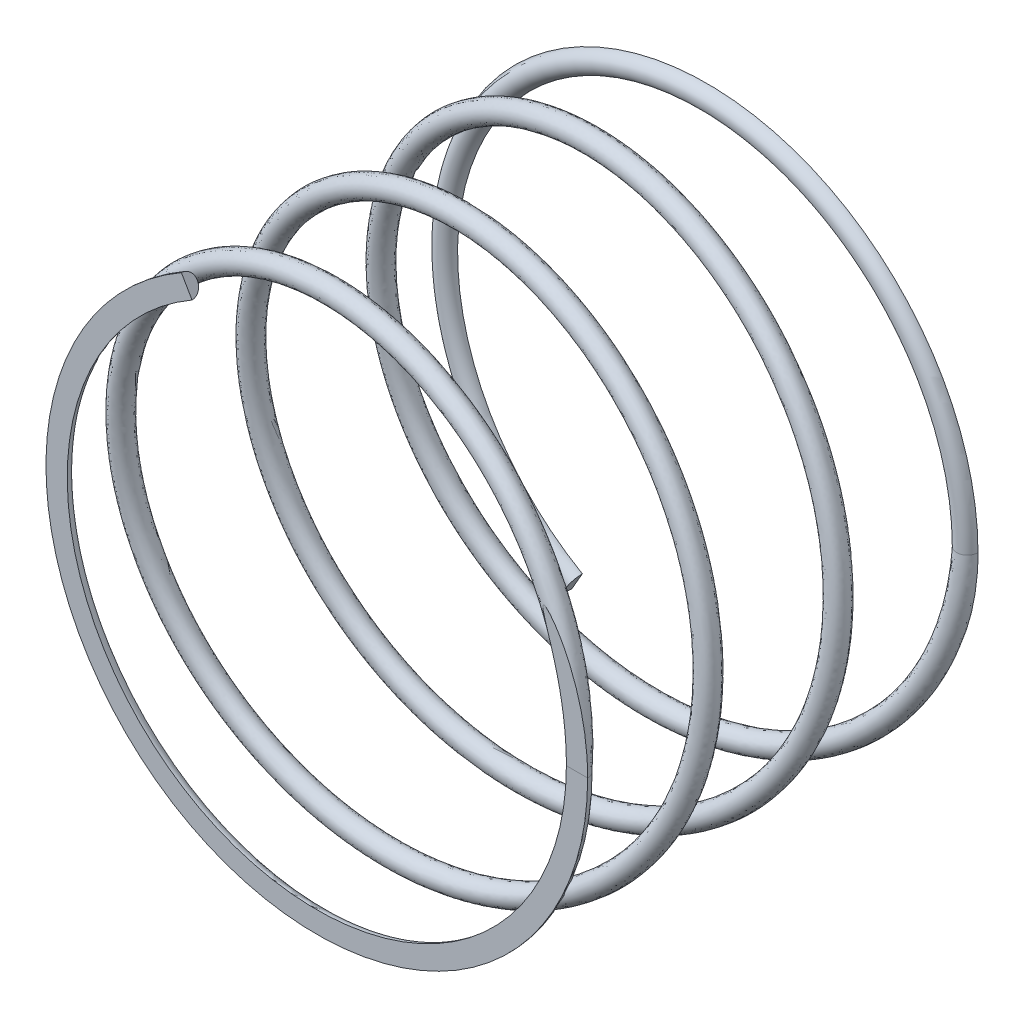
ISO-10303-21;
HEADER;
FILE_DESCRIPTION(('STEP AP214'),'2;1');
FILE_NAME('part.step','',(''),(''),'','','');
FILE_SCHEMA(('AUTOMOTIVE_DESIGN { 1 0 10303 214 1 1 1 1 }'));
ENDSEC;
DATA;
#1=APPLICATION_CONTEXT('core data for automotive mechanical design processes');
#2=APPLICATION_PROTOCOL_DEFINITION('international standard','automotive_design',2000,#1);
#3=PRODUCT_CONTEXT('',#1,'mechanical');
#4=PRODUCT('Part','Part','',(#3));
#5=PRODUCT_RELATED_PRODUCT_CATEGORY('part','',(#4));
#6=PRODUCT_DEFINITION_FORMATION('','',#4);
#7=PRODUCT_DEFINITION_CONTEXT('part definition',#1,'design');
#8=PRODUCT_DEFINITION('design','',#6,#7);
#9=PRODUCT_DEFINITION_SHAPE('','',#8);
#10=(LENGTH_UNIT() NAMED_UNIT(*) SI_UNIT(.MILLI.,.METRE.));
#11=(NAMED_UNIT(*) PLANE_ANGLE_UNIT() SI_UNIT($,.RADIAN.));
#12=(NAMED_UNIT(*) SI_UNIT($,.STERADIAN.) SOLID_ANGLE_UNIT());
#13=UNCERTAINTY_MEASURE_WITH_UNIT(LENGTH_MEASURE(1.E-05),#10,'distance_accuracy_value','');
#14=(GEOMETRIC_REPRESENTATION_CONTEXT(3) GLOBAL_UNCERTAINTY_ASSIGNED_CONTEXT((#13)) GLOBAL_UNIT_ASSIGNED_CONTEXT((#10,
#11,#12)) REPRESENTATION_CONTEXT('',''));
#15=CARTESIAN_POINT('',(0.,0.,0.));
#16=DIRECTION('',(0.,0.,1.));
#17=DIRECTION('',(1.,0.,0.));
#18=AXIS2_PLACEMENT_3D('',#15,#16,#17);
#19=CARTESIAN_POINT('',(11.,0.,0.45));
#20=CARTESIAN_POINT('',(11.,-2.94744111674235,0.679166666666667));
#21=CARTESIAN_POINT('',(9.52627944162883,-5.5,0.908333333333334));
#22=CARTESIAN_POINT('',(8.05255888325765,-8.05255888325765,1.1375));
#23=CARTESIAN_POINT('',(5.5,-9.52627944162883,1.36666666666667));
#24=CARTESIAN_POINT('',(2.94744111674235,-11.,1.59583333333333));
#25=CARTESIAN_POINT('',(0.,-11.,1.825));
#26=CARTESIAN_POINT('',(-2.94744111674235,-11.,2.05416666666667));
#27=CARTESIAN_POINT('',(-5.5,-9.52627944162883,2.28333333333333));
#28=CARTESIAN_POINT('',(-8.05255888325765,-8.05255888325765,2.5125));
#29=CARTESIAN_POINT('',(-9.52627944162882,-5.5,2.74166666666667));
#30=CARTESIAN_POINT('',(-11.,-2.94744111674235,2.97083333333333));
#31=CARTESIAN_POINT('',(-11.,0.,3.2));
#32=CARTESIAN_POINT('',(-11.,2.94744111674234,3.42916666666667));
#33=CARTESIAN_POINT('',(-9.52627944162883,5.5,3.65833333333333));
#34=CARTESIAN_POINT('',(-8.05255888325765,8.05255888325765,3.8875));
#35=CARTESIAN_POINT('',(-5.50000000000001,9.52627944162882,4.11666666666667));
#36=CARTESIAN_POINT('',(-2.94744111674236,11.,4.34583333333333));
#37=CARTESIAN_POINT('',(0.,11.,4.575));
#38=CARTESIAN_POINT('',(2.94744111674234,11.,4.80416666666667));
#39=CARTESIAN_POINT('',(5.49999999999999,9.52627944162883,5.03333333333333));
#40=CARTESIAN_POINT('',(8.05255888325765,8.05255888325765,5.2625));
#41=CARTESIAN_POINT('',(9.52627944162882,5.50000000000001,5.49166666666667));
#42=CARTESIAN_POINT('',(11.,2.94744111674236,5.72083333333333));
#43=CARTESIAN_POINT('',(11.,0.,5.95));
#44=CARTESIAN_POINT('',(11.,-2.94744111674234,6.17916666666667));
#45=CARTESIAN_POINT('',(9.52627944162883,-5.49999999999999,6.40833333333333));
#46=CARTESIAN_POINT('',(8.05255888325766,-8.05255888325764,6.6375));
#47=CARTESIAN_POINT('',(5.50000000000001,-9.52627944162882,6.86666666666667));
#48=CARTESIAN_POINT('',(2.94744111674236,-11.,7.09583333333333));
#49=CARTESIAN_POINT('',(0.,-11.,7.325));
#50=CARTESIAN_POINT('',(-2.94744111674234,-11.,7.55416666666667));
#51=CARTESIAN_POINT('',(-5.49999999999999,-9.52627944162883,7.78333333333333));
#52=CARTESIAN_POINT('',(-8.05255888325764,-8.05255888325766,8.0125));
#53=CARTESIAN_POINT('',(-9.52627944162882,-5.50000000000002,8.24166666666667));
#54=CARTESIAN_POINT('',(-11.,-2.94744111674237,8.47083333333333));
#55=CARTESIAN_POINT('',(-11.,0.,8.7));
#56=CARTESIAN_POINT('',(-11.,2.94744111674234,8.92916666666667));
#57=CARTESIAN_POINT('',(-9.52627944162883,5.49999999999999,9.15833333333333));
#58=CARTESIAN_POINT('',(-8.05255888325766,8.05255888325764,9.3875));
#59=CARTESIAN_POINT('',(-5.50000000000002,9.52627944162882,9.61666666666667));
#60=CARTESIAN_POINT('',(-2.94744111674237,11.,9.84583333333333));
#61=CARTESIAN_POINT('',(0.,11.,10.075));
#62=CARTESIAN_POINT('',(2.94744111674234,11.,10.3041666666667));
#63=CARTESIAN_POINT('',(5.49999999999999,9.52627944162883,10.5333333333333));
#64=CARTESIAN_POINT('',(8.05255888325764,8.05255888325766,10.7625));
#65=CARTESIAN_POINT('',(9.52627944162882,5.50000000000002,10.9916666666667));
#66=CARTESIAN_POINT('',(11.,2.94744111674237,11.2208333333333));
#67=CARTESIAN_POINT('',(11.,0.,11.45));
#68=CARTESIAN_POINT('',(11.,-2.94744111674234,11.6791666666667));
#69=CARTESIAN_POINT('',(9.52627944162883,-5.49999999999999,11.9083333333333));
#70=CARTESIAN_POINT('',(8.05255888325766,-8.05255888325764,12.1375));
#71=CARTESIAN_POINT('',(5.50000000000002,-9.52627944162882,12.3666666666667));
#72=CARTESIAN_POINT('',(2.94744111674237,-11.,12.5958333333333));
#73=CARTESIAN_POINT('',(0.,-11.,12.825));
#74=CARTESIAN_POINT('',(-2.94744111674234,-11.,13.0541666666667));
#75=CARTESIAN_POINT('',(-5.49999999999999,-9.52627944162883,13.2833333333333));
#76=CARTESIAN_POINT('',(-8.05255888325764,-8.05255888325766,13.5125));
#77=CARTESIAN_POINT('',(-9.52627944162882,-5.50000000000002,13.7416666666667));
#78=CARTESIAN_POINT('',(-11.,-2.94744111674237,13.9708333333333));
#79=CARTESIAN_POINT('',(-11.,0.,14.2));
#80=CARTESIAN_POINT('',(-11.,2.94744111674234,14.4291666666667));
#81=CARTESIAN_POINT('',(-9.52627944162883,5.49999999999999,14.6583333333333));
#82=CARTESIAN_POINT('',(-8.05255888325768,8.05255888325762,14.8875));
#83=CARTESIAN_POINT('',(-5.50000000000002,9.52627944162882,15.1166666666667));
#84=CARTESIAN_POINT('',(-2.94744111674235,11.,15.3458333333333));
#85=CARTESIAN_POINT('',(0.,11.,15.575));
#86=CARTESIAN_POINT('',(2.94744111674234,11.,15.8041666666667));
#87=CARTESIAN_POINT('',(5.49999999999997,9.52627944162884,16.0333333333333));
#88=CARTESIAN_POINT('',(8.05255888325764,8.05255888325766,16.2625));
#89=CARTESIAN_POINT('',(9.52627944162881,5.50000000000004,16.4916666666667));
#90=CARTESIAN_POINT('',(11.,2.94744111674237,16.7208333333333));
#91=CARTESIAN_POINT('',(11.,0.,16.95));
#92=CARTESIAN_POINT('',(11.1177124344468,0.,0.45));
#93=CARTESIAN_POINT('',(11.1177124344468,-2.97898206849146,0.679166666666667));
#94=CARTESIAN_POINT('',(9.62822140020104,-5.55885621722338,0.908333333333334));
#95=CARTESIAN_POINT('',(8.13873036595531,-8.13873036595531,1.1375));
#96=CARTESIAN_POINT('',(5.55885621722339,-9.62822140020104,1.36666666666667));
#97=CARTESIAN_POINT('',(2.97898206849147,-11.1177124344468,1.59583333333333));
#98=CARTESIAN_POINT('',(0.,-11.1177124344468,1.825));
#99=CARTESIAN_POINT('',(-2.97898206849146,-11.1177124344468,2.05416666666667));
#100=CARTESIAN_POINT('',(-5.55885621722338,-9.62822140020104,2.28333333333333));
#101=CARTESIAN_POINT('',(-8.13873036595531,-8.13873036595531,2.5125));
#102=CARTESIAN_POINT('',(-9.62822140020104,-5.55885621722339,2.74166666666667));
#103=CARTESIAN_POINT('',(-11.1177124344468,-2.97898206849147,2.97083333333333));
#104=CARTESIAN_POINT('',(-11.1177124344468,0.,3.2));
#105=CARTESIAN_POINT('',(-11.1177124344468,2.97898206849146,3.42916666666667));
#106=CARTESIAN_POINT('',(-9.62822140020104,5.55885621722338,3.65833333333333));
#107=CARTESIAN_POINT('',(-8.13873036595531,8.1387303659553,3.8875));
#108=CARTESIAN_POINT('',(-5.55885621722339,9.62822140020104,4.11666666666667));
#109=CARTESIAN_POINT('',(-2.97898206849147,11.1177124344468,4.34583333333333));
#110=CARTESIAN_POINT('',(0.,11.1177124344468,4.575));
#111=CARTESIAN_POINT('',(2.97898206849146,11.1177124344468,4.80416666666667));
#112=CARTESIAN_POINT('',(5.55885621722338,9.62822140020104,5.03333333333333));
#113=CARTESIAN_POINT('',(8.1387303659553,8.13873036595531,5.2625));
#114=CARTESIAN_POINT('',(9.62822140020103,5.55885621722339,5.49166666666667));
#115=CARTESIAN_POINT('',(11.1177124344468,2.97898206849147,5.72083333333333));
#116=CARTESIAN_POINT('',(11.1177124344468,0.,5.95));
#117=CARTESIAN_POINT('',(11.1177124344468,-2.97898206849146,6.17916666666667));
#118=CARTESIAN_POINT('',(9.62822140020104,-5.55885621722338,6.40833333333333));
#119=CARTESIAN_POINT('',(8.13873036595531,-8.1387303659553,6.6375));
#120=CARTESIAN_POINT('',(5.55885621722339,-9.62822140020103,6.86666666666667));
#121=CARTESIAN_POINT('',(2.97898206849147,-11.1177124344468,7.09583333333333));
#122=CARTESIAN_POINT('',(0.,-11.1177124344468,7.325));
#123=CARTESIAN_POINT('',(-2.97898206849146,-11.1177124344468,7.55416666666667));
#124=CARTESIAN_POINT('',(-5.55885621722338,-9.62822140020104,7.78333333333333));
#125=CARTESIAN_POINT('',(-8.1387303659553,-8.13873036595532,8.0125));
#126=CARTESIAN_POINT('',(-9.62822140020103,-5.5588562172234,8.24166666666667));
#127=CARTESIAN_POINT('',(-11.1177124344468,-2.97898206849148,8.47083333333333));
#128=CARTESIAN_POINT('',(-11.1177124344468,0.,8.7));
#129=CARTESIAN_POINT('',(-11.1177124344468,2.97898206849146,8.92916666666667));
#130=CARTESIAN_POINT('',(-9.62822140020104,5.55885621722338,9.15833333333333));
#131=CARTESIAN_POINT('',(-8.13873036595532,8.1387303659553,9.3875));
#132=CARTESIAN_POINT('',(-5.5588562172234,9.62822140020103,9.61666666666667));
#133=CARTESIAN_POINT('',(-2.97898206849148,11.1177124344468,9.84583333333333));
#134=CARTESIAN_POINT('',(0.,11.1177124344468,10.075));
#135=CARTESIAN_POINT('',(2.97898206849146,11.1177124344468,10.3041666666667));
#136=CARTESIAN_POINT('',(5.55885621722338,9.62822140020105,10.5333333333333));
#137=CARTESIAN_POINT('',(8.1387303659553,8.13873036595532,10.7625));
#138=CARTESIAN_POINT('',(9.62822140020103,5.5588562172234,10.9916666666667));
#139=CARTESIAN_POINT('',(11.1177124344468,2.97898206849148,11.2208333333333));
#140=CARTESIAN_POINT('',(11.1177124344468,0.,11.45));
#141=CARTESIAN_POINT('',(11.1177124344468,-2.97898206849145,11.6791666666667));
#142=CARTESIAN_POINT('',(9.62822140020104,-5.55885621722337,11.9083333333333));
#143=CARTESIAN_POINT('',(8.13873036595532,-8.13873036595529,12.1375));
#144=CARTESIAN_POINT('',(5.5588562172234,-9.62822140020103,12.3666666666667));
#145=CARTESIAN_POINT('',(2.97898206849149,-11.1177124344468,12.5958333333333));
#146=CARTESIAN_POINT('',(0.,-11.1177124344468,12.825));
#147=CARTESIAN_POINT('',(-2.97898206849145,-11.1177124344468,13.0541666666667));
#148=CARTESIAN_POINT('',(-5.55885621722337,-9.62822140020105,13.2833333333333));
#149=CARTESIAN_POINT('',(-8.13873036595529,-8.13873036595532,13.5125));
#150=CARTESIAN_POINT('',(-9.62822140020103,-5.5588562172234,13.7416666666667));
#151=CARTESIAN_POINT('',(-11.1177124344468,-2.97898206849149,13.9708333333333));
#152=CARTESIAN_POINT('',(-11.1177124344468,0.,14.2));
#153=CARTESIAN_POINT('',(-11.1177124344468,2.97898206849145,14.4291666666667));
#154=CARTESIAN_POINT('',(-9.62822140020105,5.55885621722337,14.6583333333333));
#155=CARTESIAN_POINT('',(-8.13873036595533,8.13873036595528,14.8875));
#156=CARTESIAN_POINT('',(-5.5588562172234,9.62822140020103,15.1166666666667));
#157=CARTESIAN_POINT('',(-2.97898206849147,11.1177124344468,15.3458333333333));
#158=CARTESIAN_POINT('',(0.,11.1177124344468,15.575));
#159=CARTESIAN_POINT('',(2.97898206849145,11.1177124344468,15.8041666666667));
#160=CARTESIAN_POINT('',(5.55885621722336,9.62822140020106,16.0333333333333));
#161=CARTESIAN_POINT('',(8.13873036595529,8.13873036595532,16.2625));
#162=CARTESIAN_POINT('',(9.62822140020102,5.55885621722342,16.4916666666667));
#163=CARTESIAN_POINT('',(11.1177124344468,2.97898206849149,16.7208333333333));
#164=CARTESIAN_POINT('',(11.1177124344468,0.,16.95));
#165=CARTESIAN_POINT('',(11.45,0.,0.38228756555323));
#166=CARTESIAN_POINT('',(11.45,-3.06801825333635,0.611454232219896));
#167=CARTESIAN_POINT('',(9.91599087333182,-5.725,0.840620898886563));
#168=CARTESIAN_POINT('',(8.38198174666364,-8.38198174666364,1.06978756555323));
#169=CARTESIAN_POINT('',(5.725,-9.91599087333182,1.2989542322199));
#170=CARTESIAN_POINT('',(3.06801825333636,-11.45,1.52812089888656));
#171=CARTESIAN_POINT('',(0.,-11.45,1.75728756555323));
#172=CARTESIAN_POINT('',(-3.06801825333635,-11.45,1.9864542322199));
#173=CARTESIAN_POINT('',(-5.725,-9.91599087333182,2.21562089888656));
#174=CARTESIAN_POINT('',(-8.38198174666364,-8.38198174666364,2.44478756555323));
#175=CARTESIAN_POINT('',(-9.91599087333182,-5.725,2.6739542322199));
#176=CARTESIAN_POINT('',(-11.45,-3.06801825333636,2.90312089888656));
#177=CARTESIAN_POINT('',(-11.45,0.,3.13228756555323));
#178=CARTESIAN_POINT('',(-11.45,3.06801825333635,3.3614542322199));
#179=CARTESIAN_POINT('',(-9.91599087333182,5.725,3.59062089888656));
#180=CARTESIAN_POINT('',(-8.38198174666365,8.38198174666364,3.81978756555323));
#181=CARTESIAN_POINT('',(-5.725,9.91599087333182,4.0489542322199));
#182=CARTESIAN_POINT('',(-3.06801825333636,11.45,4.27812089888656));
#183=CARTESIAN_POINT('',(0.,11.45,4.50728756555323));
#184=CARTESIAN_POINT('',(3.06801825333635,11.45,4.7364542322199));
#185=CARTESIAN_POINT('',(5.72499999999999,9.91599087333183,4.96562089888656));
#186=CARTESIAN_POINT('',(8.38198174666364,8.38198174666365,5.19478756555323));
#187=CARTESIAN_POINT('',(9.91599087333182,5.725,5.4239542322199));
#188=CARTESIAN_POINT('',(11.45,3.06801825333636,5.65312089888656));
#189=CARTESIAN_POINT('',(11.45,0.,5.88228756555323));
#190=CARTESIAN_POINT('',(11.45,-3.06801825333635,6.1114542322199));
#191=CARTESIAN_POINT('',(9.91599087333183,-5.72499999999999,6.34062089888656));
#192=CARTESIAN_POINT('',(8.38198174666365,-8.38198174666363,6.56978756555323));
#193=CARTESIAN_POINT('',(5.725,-9.91599087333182,6.7989542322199));
#194=CARTESIAN_POINT('',(3.06801825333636,-11.45,7.02812089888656));
#195=CARTESIAN_POINT('',(0.,-11.45,7.25728756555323));
#196=CARTESIAN_POINT('',(-3.06801825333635,-11.45,7.4864542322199));
#197=CARTESIAN_POINT('',(-5.72499999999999,-9.91599087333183,7.71562089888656));
#198=CARTESIAN_POINT('',(-8.38198174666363,-8.38198174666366,7.94478756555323));
#199=CARTESIAN_POINT('',(-9.91599087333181,-5.72500000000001,8.1739542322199));
#200=CARTESIAN_POINT('',(-11.45,-3.06801825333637,8.40312089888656));
#201=CARTESIAN_POINT('',(-11.45,0.,8.63228756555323));
#202=CARTESIAN_POINT('',(-11.45,3.06801825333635,8.8614542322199));
#203=CARTESIAN_POINT('',(-9.91599087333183,5.72499999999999,9.09062089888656));
#204=CARTESIAN_POINT('',(-8.38198174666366,8.38198174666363,9.31978756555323));
#205=CARTESIAN_POINT('',(-5.72500000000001,9.91599087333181,9.5489542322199));
#206=CARTESIAN_POINT('',(-3.06801825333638,11.45,9.77812089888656));
#207=CARTESIAN_POINT('',(0.,11.45,10.0072875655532));
#208=CARTESIAN_POINT('',(3.06801825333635,11.45,10.2364542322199));
#209=CARTESIAN_POINT('',(5.72499999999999,9.91599087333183,10.4656208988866));
#210=CARTESIAN_POINT('',(8.38198174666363,8.38198174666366,10.6947875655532));
#211=CARTESIAN_POINT('',(9.91599087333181,5.72500000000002,10.9239542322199));
#212=CARTESIAN_POINT('',(11.45,3.06801825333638,11.1531208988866));
#213=CARTESIAN_POINT('',(11.45,0.,11.3822875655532));
#214=CARTESIAN_POINT('',(11.45,-3.06801825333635,11.6114542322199));
#215=CARTESIAN_POINT('',(9.91599087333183,-5.72499999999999,11.8406208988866));
#216=CARTESIAN_POINT('',(8.38198174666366,-8.38198174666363,12.0697875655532));
#217=CARTESIAN_POINT('',(5.72500000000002,-9.91599087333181,12.2989542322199));
#218=CARTESIAN_POINT('',(3.06801825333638,-11.45,12.5281208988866));
#219=CARTESIAN_POINT('',(0.,-11.45,12.7572875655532));
#220=CARTESIAN_POINT('',(-3.06801825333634,-11.45,12.9864542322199));
#221=CARTESIAN_POINT('',(-5.72499999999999,-9.91599087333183,13.2156208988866));
#222=CARTESIAN_POINT('',(-8.38198174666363,-8.38198174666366,13.4447875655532));
#223=CARTESIAN_POINT('',(-9.91599087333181,-5.72500000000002,13.6739542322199));
#224=CARTESIAN_POINT('',(-11.45,-3.06801825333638,13.9031208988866));
#225=CARTESIAN_POINT('',(-11.45,0.,14.1322875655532));
#226=CARTESIAN_POINT('',(-11.45,3.06801825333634,14.3614542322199));
#227=CARTESIAN_POINT('',(-9.91599087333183,5.72499999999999,14.5906208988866));
#228=CARTESIAN_POINT('',(-8.38198174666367,8.38198174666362,14.8197875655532));
#229=CARTESIAN_POINT('',(-5.72500000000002,9.91599087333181,15.0489542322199));
#230=CARTESIAN_POINT('',(-3.06801825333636,11.45,15.2781208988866));
#231=CARTESIAN_POINT('',(0.,11.45,15.5072875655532));
#232=CARTESIAN_POINT('',(3.06801825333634,11.45,15.7364542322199));
#233=CARTESIAN_POINT('',(5.72499999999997,9.91599087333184,15.9656208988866));
#234=CARTESIAN_POINT('',(8.38198174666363,8.38198174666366,16.1947875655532));
#235=CARTESIAN_POINT('',(9.9159908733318,5.72500000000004,16.4239542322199));
#236=CARTESIAN_POINT('',(11.45,3.06801825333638,16.6531208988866));
#237=CARTESIAN_POINT('',(11.45,0.,16.8822875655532));
#238=CARTESIAN_POINT('',(11.45,0.,-0.38228756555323));
#239=CARTESIAN_POINT('',(11.45,-3.06801825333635,-0.153120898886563));
#240=CARTESIAN_POINT('',(9.91599087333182,-5.725,0.0760457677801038));
#241=CARTESIAN_POINT('',(8.38198174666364,-8.38198174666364,0.30521243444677));
#242=CARTESIAN_POINT('',(5.725,-9.91599087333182,0.534379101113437));
#243=CARTESIAN_POINT('',(3.06801825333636,-11.45,0.763545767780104));
#244=CARTESIAN_POINT('',(0.,-11.45,0.99271243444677));
#245=CARTESIAN_POINT('',(-3.06801825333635,-11.45,1.22187910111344));
#246=CARTESIAN_POINT('',(-5.725,-9.91599087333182,1.4510457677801));
#247=CARTESIAN_POINT('',(-8.38198174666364,-8.38198174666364,1.68021243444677));
#248=CARTESIAN_POINT('',(-9.91599087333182,-5.725,1.90937910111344));
#249=CARTESIAN_POINT('',(-11.45,-3.06801825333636,2.1385457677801));
#250=CARTESIAN_POINT('',(-11.45,0.,2.36771243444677));
#251=CARTESIAN_POINT('',(-11.45,3.06801825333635,2.59687910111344));
#252=CARTESIAN_POINT('',(-9.91599087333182,5.725,2.8260457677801));
#253=CARTESIAN_POINT('',(-8.38198174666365,8.38198174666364,3.05521243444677));
#254=CARTESIAN_POINT('',(-5.725,9.91599087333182,3.28437910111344));
#255=CARTESIAN_POINT('',(-3.06801825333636,11.45,3.5135457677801));
#256=CARTESIAN_POINT('',(0.,11.45,3.74271243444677));
#257=CARTESIAN_POINT('',(3.06801825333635,11.45,3.97187910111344));
#258=CARTESIAN_POINT('',(5.72499999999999,9.91599087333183,4.2010457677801));
#259=CARTESIAN_POINT('',(8.38198174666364,8.38198174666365,4.43021243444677));
#260=CARTESIAN_POINT('',(9.91599087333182,5.725,4.65937910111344));
#261=CARTESIAN_POINT('',(11.45,3.06801825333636,4.8885457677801));
#262=CARTESIAN_POINT('',(11.45,0.,5.11771243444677));
#263=CARTESIAN_POINT('',(11.45,-3.06801825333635,5.34687910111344));
#264=CARTESIAN_POINT('',(9.91599087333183,-5.72499999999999,5.5760457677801));
#265=CARTESIAN_POINT('',(8.38198174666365,-8.38198174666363,5.80521243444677));
#266=CARTESIAN_POINT('',(5.725,-9.91599087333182,6.03437910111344));
#267=CARTESIAN_POINT('',(3.06801825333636,-11.45,6.2635457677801));
#268=CARTESIAN_POINT('',(0.,-11.45,6.49271243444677));
#269=CARTESIAN_POINT('',(-3.06801825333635,-11.45,6.72187910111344));
#270=CARTESIAN_POINT('',(-5.72499999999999,-9.91599087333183,6.9510457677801));
#271=CARTESIAN_POINT('',(-8.38198174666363,-8.38198174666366,7.18021243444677));
#272=CARTESIAN_POINT('',(-9.91599087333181,-5.72500000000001,7.40937910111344));
#273=CARTESIAN_POINT('',(-11.45,-3.06801825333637,7.6385457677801));
#274=CARTESIAN_POINT('',(-11.45,0.,7.86771243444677));
#275=CARTESIAN_POINT('',(-11.45,3.06801825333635,8.09687910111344));
#276=CARTESIAN_POINT('',(-9.91599087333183,5.72499999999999,8.3260457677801));
#277=CARTESIAN_POINT('',(-8.38198174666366,8.38198174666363,8.55521243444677));
#278=CARTESIAN_POINT('',(-5.72500000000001,9.91599087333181,8.78437910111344));
#279=CARTESIAN_POINT('',(-3.06801825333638,11.45,9.0135457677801));
#280=CARTESIAN_POINT('',(0.,11.45,9.24271243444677));
#281=CARTESIAN_POINT('',(3.06801825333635,11.45,9.47187910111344));
#282=CARTESIAN_POINT('',(5.72499999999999,9.91599087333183,9.7010457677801));
#283=CARTESIAN_POINT('',(8.38198174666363,8.38198174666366,9.93021243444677));
#284=CARTESIAN_POINT('',(9.91599087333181,5.72500000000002,10.1593791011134));
#285=CARTESIAN_POINT('',(11.45,3.06801825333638,10.3885457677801));
#286=CARTESIAN_POINT('',(11.45,0.,10.6177124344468));
#287=CARTESIAN_POINT('',(11.45,-3.06801825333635,10.8468791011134));
#288=CARTESIAN_POINT('',(9.91599087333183,-5.72499999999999,11.0760457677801));
#289=CARTESIAN_POINT('',(8.38198174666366,-8.38198174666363,11.3052124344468));
#290=CARTESIAN_POINT('',(5.72500000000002,-9.91599087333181,11.5343791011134));
#291=CARTESIAN_POINT('',(3.06801825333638,-11.45,11.7635457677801));
#292=CARTESIAN_POINT('',(0.,-11.45,11.9927124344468));
#293=CARTESIAN_POINT('',(-3.06801825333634,-11.45,12.2218791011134));
#294=CARTESIAN_POINT('',(-5.72499999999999,-9.91599087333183,12.4510457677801));
#295=CARTESIAN_POINT('',(-8.38198174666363,-8.38198174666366,12.6802124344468));
#296=CARTESIAN_POINT('',(-9.91599087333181,-5.72500000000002,12.9093791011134));
#297=CARTESIAN_POINT('',(-11.45,-3.06801825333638,13.1385457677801));
#298=CARTESIAN_POINT('',(-11.45,0.,13.3677124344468));
#299=CARTESIAN_POINT('',(-11.45,3.06801825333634,13.5968791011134));
#300=CARTESIAN_POINT('',(-9.91599087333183,5.72499999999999,13.8260457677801));
#301=CARTESIAN_POINT('',(-8.38198174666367,8.38198174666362,14.0552124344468));
#302=CARTESIAN_POINT('',(-5.72500000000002,9.91599087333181,14.2843791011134));
#303=CARTESIAN_POINT('',(-3.06801825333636,11.45,14.5135457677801));
#304=CARTESIAN_POINT('',(0.,11.45,14.7427124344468));
#305=CARTESIAN_POINT('',(3.06801825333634,11.45,14.9718791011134));
#306=CARTESIAN_POINT('',(5.72499999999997,9.91599087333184,15.2010457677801));
#307=CARTESIAN_POINT('',(8.38198174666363,8.38198174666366,15.4302124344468));
#308=CARTESIAN_POINT('',(9.9159908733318,5.72500000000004,15.6593791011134));
#309=CARTESIAN_POINT('',(11.45,3.06801825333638,15.8885457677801));
#310=CARTESIAN_POINT('',(11.45,0.,16.1177124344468));
#311=CARTESIAN_POINT('',(11.1177124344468,0.,-0.45));
#312=CARTESIAN_POINT('',(11.1177124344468,-2.97898206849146,-0.220833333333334));
#313=CARTESIAN_POINT('',(9.62822140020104,-5.55885621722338,0.00833333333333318));
#314=CARTESIAN_POINT('',(8.13873036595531,-8.13873036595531,0.2375));
#315=CARTESIAN_POINT('',(5.55885621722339,-9.62822140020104,0.466666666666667));
#316=CARTESIAN_POINT('',(2.97898206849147,-11.1177124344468,0.695833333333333));
#317=CARTESIAN_POINT('',(0.,-11.1177124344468,0.925));
#318=CARTESIAN_POINT('',(-2.97898206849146,-11.1177124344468,1.15416666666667));
#319=CARTESIAN_POINT('',(-5.55885621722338,-9.62822140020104,1.38333333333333));
#320=CARTESIAN_POINT('',(-8.13873036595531,-8.13873036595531,1.6125));
#321=CARTESIAN_POINT('',(-9.62822140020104,-5.55885621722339,1.84166666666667));
#322=CARTESIAN_POINT('',(-11.1177124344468,-2.97898206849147,2.07083333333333));
#323=CARTESIAN_POINT('',(-11.1177124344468,0.,2.3));
#324=CARTESIAN_POINT('',(-11.1177124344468,2.97898206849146,2.52916666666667));
#325=CARTESIAN_POINT('',(-9.62822140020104,5.55885621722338,2.75833333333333));
#326=CARTESIAN_POINT('',(-8.13873036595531,8.1387303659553,2.9875));
#327=CARTESIAN_POINT('',(-5.55885621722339,9.62822140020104,3.21666666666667));
#328=CARTESIAN_POINT('',(-2.97898206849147,11.1177124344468,3.44583333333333));
#329=CARTESIAN_POINT('',(0.,11.1177124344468,3.675));
#330=CARTESIAN_POINT('',(2.97898206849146,11.1177124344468,3.90416666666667));
#331=CARTESIAN_POINT('',(5.55885621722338,9.62822140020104,4.13333333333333));
#332=CARTESIAN_POINT('',(8.1387303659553,8.13873036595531,4.3625));
#333=CARTESIAN_POINT('',(9.62822140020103,5.55885621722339,4.59166666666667));
#334=CARTESIAN_POINT('',(11.1177124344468,2.97898206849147,4.82083333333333));
#335=CARTESIAN_POINT('',(11.1177124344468,0.,5.05));
#336=CARTESIAN_POINT('',(11.1177124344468,-2.97898206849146,5.27916666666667));
#337=CARTESIAN_POINT('',(9.62822140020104,-5.55885621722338,5.50833333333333));
#338=CARTESIAN_POINT('',(8.13873036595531,-8.1387303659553,5.7375));
#339=CARTESIAN_POINT('',(5.55885621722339,-9.62822140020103,5.96666666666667));
#340=CARTESIAN_POINT('',(2.97898206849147,-11.1177124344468,6.19583333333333));
#341=CARTESIAN_POINT('',(0.,-11.1177124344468,6.425));
#342=CARTESIAN_POINT('',(-2.97898206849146,-11.1177124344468,6.65416666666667));
#343=CARTESIAN_POINT('',(-5.55885621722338,-9.62822140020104,6.88333333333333));
#344=CARTESIAN_POINT('',(-8.1387303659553,-8.13873036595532,7.1125));
#345=CARTESIAN_POINT('',(-9.62822140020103,-5.5588562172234,7.34166666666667));
#346=CARTESIAN_POINT('',(-11.1177124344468,-2.97898206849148,7.57083333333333));
#347=CARTESIAN_POINT('',(-11.1177124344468,0.,7.8));
#348=CARTESIAN_POINT('',(-11.1177124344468,2.97898206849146,8.02916666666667));
#349=CARTESIAN_POINT('',(-9.62822140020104,5.55885621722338,8.25833333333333));
#350=CARTESIAN_POINT('',(-8.13873036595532,8.1387303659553,8.4875));
#351=CARTESIAN_POINT('',(-5.5588562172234,9.62822140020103,8.71666666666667));
#352=CARTESIAN_POINT('',(-2.97898206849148,11.1177124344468,8.94583333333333));
#353=CARTESIAN_POINT('',(0.,11.1177124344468,9.175));
#354=CARTESIAN_POINT('',(2.97898206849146,11.1177124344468,9.40416666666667));
#355=CARTESIAN_POINT('',(5.55885621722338,9.62822140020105,9.63333333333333));
#356=CARTESIAN_POINT('',(8.1387303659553,8.13873036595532,9.8625));
#357=CARTESIAN_POINT('',(9.62822140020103,5.5588562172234,10.0916666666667));
#358=CARTESIAN_POINT('',(11.1177124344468,2.97898206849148,10.3208333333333));
#359=CARTESIAN_POINT('',(11.1177124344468,0.,10.55));
#360=CARTESIAN_POINT('',(11.1177124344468,-2.97898206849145,10.7791666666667));
#361=CARTESIAN_POINT('',(9.62822140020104,-5.55885621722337,11.0083333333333));
#362=CARTESIAN_POINT('',(8.13873036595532,-8.13873036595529,11.2375));
#363=CARTESIAN_POINT('',(5.5588562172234,-9.62822140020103,11.4666666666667));
#364=CARTESIAN_POINT('',(2.97898206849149,-11.1177124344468,11.6958333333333));
#365=CARTESIAN_POINT('',(0.,-11.1177124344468,11.925));
#366=CARTESIAN_POINT('',(-2.97898206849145,-11.1177124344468,12.1541666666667));
#367=CARTESIAN_POINT('',(-5.55885621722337,-9.62822140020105,12.3833333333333));
#368=CARTESIAN_POINT('',(-8.13873036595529,-8.13873036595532,12.6125));
#369=CARTESIAN_POINT('',(-9.62822140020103,-5.5588562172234,12.8416666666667));
#370=CARTESIAN_POINT('',(-11.1177124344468,-2.97898206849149,13.0708333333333));
#371=CARTESIAN_POINT('',(-11.1177124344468,0.,13.3));
#372=CARTESIAN_POINT('',(-11.1177124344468,2.97898206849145,13.5291666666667));
#373=CARTESIAN_POINT('',(-9.62822140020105,5.55885621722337,13.7583333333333));
#374=CARTESIAN_POINT('',(-8.13873036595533,8.13873036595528,13.9875));
#375=CARTESIAN_POINT('',(-5.5588562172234,9.62822140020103,14.2166666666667));
#376=CARTESIAN_POINT('',(-2.97898206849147,11.1177124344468,14.4458333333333));
#377=CARTESIAN_POINT('',(0.,11.1177124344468,14.675));
#378=CARTESIAN_POINT('',(2.97898206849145,11.1177124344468,14.9041666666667));
#379=CARTESIAN_POINT('',(5.55885621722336,9.62822140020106,15.1333333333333));
#380=CARTESIAN_POINT('',(8.13873036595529,8.13873036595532,15.3625));
#381=CARTESIAN_POINT('',(9.62822140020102,5.55885621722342,15.5916666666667));
#382=CARTESIAN_POINT('',(11.1177124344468,2.97898206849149,15.8208333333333));
#383=CARTESIAN_POINT('',(11.1177124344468,0.,16.05));
#384=CARTESIAN_POINT('',(10.8822875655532,0.,-0.45));
#385=CARTESIAN_POINT('',(10.8822875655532,-2.91590016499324,-0.220833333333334));
#386=CARTESIAN_POINT('',(9.42433748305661,-5.44114378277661,0.00833333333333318));
#387=CARTESIAN_POINT('',(7.96638740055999,-7.96638740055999,0.2375));
#388=CARTESIAN_POINT('',(5.44114378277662,-9.42433748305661,0.466666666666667));
#389=CARTESIAN_POINT('',(2.91590016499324,-10.8822875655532,0.695833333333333));
#390=CARTESIAN_POINT('',(0.,-10.8822875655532,0.925));
#391=CARTESIAN_POINT('',(-2.91590016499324,-10.8822875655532,1.15416666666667));
#392=CARTESIAN_POINT('',(-5.44114378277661,-9.42433748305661,1.38333333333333));
#393=CARTESIAN_POINT('',(-7.96638740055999,-7.96638740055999,1.6125));
#394=CARTESIAN_POINT('',(-9.42433748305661,-5.44114378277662,1.84166666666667));
#395=CARTESIAN_POINT('',(-10.8822875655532,-2.91590016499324,2.07083333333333));
#396=CARTESIAN_POINT('',(-10.8822875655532,0.,2.3));
#397=CARTESIAN_POINT('',(-10.8822875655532,2.91590016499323,2.52916666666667));
#398=CARTESIAN_POINT('',(-9.42433748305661,5.44114378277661,2.75833333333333));
#399=CARTESIAN_POINT('',(-7.96638740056,7.96638740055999,2.9875));
#400=CARTESIAN_POINT('',(-5.44114378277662,9.42433748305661,3.21666666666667));
#401=CARTESIAN_POINT('',(-2.91590016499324,10.8822875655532,3.44583333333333));
#402=CARTESIAN_POINT('',(0.,10.8822875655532,3.675));
#403=CARTESIAN_POINT('',(2.91590016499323,10.8822875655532,3.90416666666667));
#404=CARTESIAN_POINT('',(5.44114378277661,9.42433748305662,4.13333333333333));
#405=CARTESIAN_POINT('',(7.96638740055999,7.96638740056,4.3625));
#406=CARTESIAN_POINT('',(9.42433748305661,5.44114378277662,4.59166666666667));
#407=CARTESIAN_POINT('',(10.8822875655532,2.91590016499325,4.82083333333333));
#408=CARTESIAN_POINT('',(10.8822875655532,0.,5.05));
#409=CARTESIAN_POINT('',(10.8822875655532,-2.91590016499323,5.27916666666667));
#410=CARTESIAN_POINT('',(9.42433748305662,-5.44114378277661,5.50833333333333));
#411=CARTESIAN_POINT('',(7.96638740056,-7.96638740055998,5.7375));
#412=CARTESIAN_POINT('',(5.44114378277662,-9.42433748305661,5.96666666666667));
#413=CARTESIAN_POINT('',(2.91590016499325,-10.8822875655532,6.19583333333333));
#414=CARTESIAN_POINT('',(0.,-10.8822875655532,6.425));
#415=CARTESIAN_POINT('',(-2.91590016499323,-10.8822875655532,6.65416666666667));
#416=CARTESIAN_POINT('',(-5.44114378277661,-9.42433748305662,6.88333333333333));
#417=CARTESIAN_POINT('',(-7.96638740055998,-7.96638740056,7.1125));
#418=CARTESIAN_POINT('',(-9.4243374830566,-5.44114378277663,7.34166666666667));
#419=CARTESIAN_POINT('',(-10.8822875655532,-2.91590016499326,7.57083333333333));
#420=CARTESIAN_POINT('',(-10.8822875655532,0.,7.8));
#421=CARTESIAN_POINT('',(-10.8822875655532,2.91590016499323,8.02916666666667));
#422=CARTESIAN_POINT('',(-9.42433748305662,5.44114378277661,8.25833333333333));
#423=CARTESIAN_POINT('',(-7.96638740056,7.96638740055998,8.4875));
#424=CARTESIAN_POINT('',(-5.44114378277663,9.4243374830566,8.71666666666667));
#425=CARTESIAN_POINT('',(-2.91590016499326,10.8822875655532,8.94583333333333));
#426=CARTESIAN_POINT('',(0.,10.8822875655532,9.175));
#427=CARTESIAN_POINT('',(2.91590016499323,10.8822875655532,9.40416666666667));
#428=CARTESIAN_POINT('',(5.44114378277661,9.42433748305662,9.63333333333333));
#429=CARTESIAN_POINT('',(7.96638740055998,7.96638740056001,9.8625));
#430=CARTESIAN_POINT('',(9.4243374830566,5.44114378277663,10.0916666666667));
#431=CARTESIAN_POINT('',(10.8822875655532,2.91590016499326,10.3208333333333));
#432=CARTESIAN_POINT('',(10.8822875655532,0.,10.55));
#433=CARTESIAN_POINT('',(10.8822875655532,-2.91590016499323,10.7791666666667));
#434=CARTESIAN_POINT('',(9.42433748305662,-5.4411437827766,11.0083333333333));
#435=CARTESIAN_POINT('',(7.96638740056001,-7.96638740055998,11.2375));
#436=CARTESIAN_POINT('',(5.44114378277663,-9.4243374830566,11.4666666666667));
#437=CARTESIAN_POINT('',(2.91590016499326,-10.8822875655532,11.6958333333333));
#438=CARTESIAN_POINT('',(0.,-10.8822875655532,11.925));
#439=CARTESIAN_POINT('',(-2.91590016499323,-10.8822875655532,12.1541666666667));
#440=CARTESIAN_POINT('',(-5.4411437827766,-9.42433748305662,12.3833333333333));
#441=CARTESIAN_POINT('',(-7.96638740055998,-7.96638740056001,12.6125));
#442=CARTESIAN_POINT('',(-9.4243374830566,-5.44114378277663,12.8416666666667));
#443=CARTESIAN_POINT('',(-10.8822875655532,-2.91590016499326,13.0708333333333));
#444=CARTESIAN_POINT('',(-10.8822875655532,0.,13.3));
#445=CARTESIAN_POINT('',(-10.8822875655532,2.91590016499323,13.5291666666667));
#446=CARTESIAN_POINT('',(-9.42433748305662,5.4411437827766,13.7583333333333));
#447=CARTESIAN_POINT('',(-7.96638740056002,7.96638740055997,13.9875));
#448=CARTESIAN_POINT('',(-5.44114378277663,9.4243374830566,14.2166666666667));
#449=CARTESIAN_POINT('',(-2.91590016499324,10.8822875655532,14.4458333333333));
#450=CARTESIAN_POINT('',(0.,10.8822875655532,14.675));
#451=CARTESIAN_POINT('',(2.91590016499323,10.8822875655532,14.9041666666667));
#452=CARTESIAN_POINT('',(5.44114378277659,9.42433748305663,15.1333333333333));
#453=CARTESIAN_POINT('',(7.96638740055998,7.96638740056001,15.3625));
#454=CARTESIAN_POINT('',(9.42433748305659,5.44114378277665,15.5916666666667));
#455=CARTESIAN_POINT('',(10.8822875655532,2.91590016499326,15.8208333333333));
#456=CARTESIAN_POINT('',(10.8822875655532,0.,16.05));
#457=CARTESIAN_POINT('',(10.55,0.,-0.38228756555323));
#458=CARTESIAN_POINT('',(10.55,-2.82686398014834,-0.153120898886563));
#459=CARTESIAN_POINT('',(9.13656800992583,-5.275,0.0760457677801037));
#460=CARTESIAN_POINT('',(7.72313601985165,-7.72313601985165,0.30521243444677));
#461=CARTESIAN_POINT('',(5.275,-9.13656800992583,0.534379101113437));
#462=CARTESIAN_POINT('',(2.82686398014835,-10.55,0.763545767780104));
#463=CARTESIAN_POINT('',(0.,-10.55,0.99271243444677));
#464=CARTESIAN_POINT('',(-2.82686398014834,-10.55,1.22187910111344));
#465=CARTESIAN_POINT('',(-5.275,-9.13656800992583,1.4510457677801));
#466=CARTESIAN_POINT('',(-7.72313601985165,-7.72313601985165,1.68021243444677));
#467=CARTESIAN_POINT('',(-9.13656800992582,-5.275,1.90937910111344));
#468=CARTESIAN_POINT('',(-10.55,-2.82686398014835,2.1385457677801));
#469=CARTESIAN_POINT('',(-10.55,0.,2.36771243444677));
#470=CARTESIAN_POINT('',(-10.55,2.82686398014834,2.59687910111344));
#471=CARTESIAN_POINT('',(-9.13656800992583,5.275,2.8260457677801));
#472=CARTESIAN_POINT('',(-7.72313601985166,7.72313601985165,3.05521243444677));
#473=CARTESIAN_POINT('',(-5.275,9.13656800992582,3.28437910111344));
#474=CARTESIAN_POINT('',(-2.82686398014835,10.55,3.5135457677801));
#475=CARTESIAN_POINT('',(0.,10.55,3.74271243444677));
#476=CARTESIAN_POINT('',(2.82686398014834,10.55,3.97187910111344));
#477=CARTESIAN_POINT('',(5.27499999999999,9.13656800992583,4.2010457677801));
#478=CARTESIAN_POINT('',(7.72313601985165,7.72313601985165,4.43021243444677));
#479=CARTESIAN_POINT('',(9.13656800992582,5.275,4.65937910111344));
#480=CARTESIAN_POINT('',(10.55,2.82686398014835,4.8885457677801));
#481=CARTESIAN_POINT('',(10.55,0.,5.11771243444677));
#482=CARTESIAN_POINT('',(10.55,-2.82686398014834,5.34687910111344));
#483=CARTESIAN_POINT('',(9.13656800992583,-5.27499999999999,5.5760457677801));
#484=CARTESIAN_POINT('',(7.72313601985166,-7.72313601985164,5.80521243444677));
#485=CARTESIAN_POINT('',(5.275,-9.13656800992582,6.03437910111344));
#486=CARTESIAN_POINT('',(2.82686398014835,-10.55,6.2635457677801));
#487=CARTESIAN_POINT('',(0.,-10.55,6.49271243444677));
#488=CARTESIAN_POINT('',(-2.82686398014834,-10.55,6.72187910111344));
#489=CARTESIAN_POINT('',(-5.27499999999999,-9.13656800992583,6.9510457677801));
#490=CARTESIAN_POINT('',(-7.72313601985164,-7.72313601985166,7.18021243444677));
#491=CARTESIAN_POINT('',(-9.13656800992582,-5.27500000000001,7.40937910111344));
#492=CARTESIAN_POINT('',(-10.55,-2.82686398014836,7.6385457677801));
#493=CARTESIAN_POINT('',(-10.55,0.,7.86771243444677));
#494=CARTESIAN_POINT('',(-10.55,2.82686398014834,8.09687910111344));
#495=CARTESIAN_POINT('',(-9.13656800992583,5.27499999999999,8.3260457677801));
#496=CARTESIAN_POINT('',(-7.72313601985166,7.72313601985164,8.55521243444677));
#497=CARTESIAN_POINT('',(-5.27500000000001,9.13656800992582,8.78437910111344));
#498=CARTESIAN_POINT('',(-2.82686398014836,10.55,9.0135457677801));
#499=CARTESIAN_POINT('',(0.,10.55,9.24271243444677));
#500=CARTESIAN_POINT('',(2.82686398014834,10.55,9.47187910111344));
#501=CARTESIAN_POINT('',(5.27499999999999,9.13656800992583,9.7010457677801));
#502=CARTESIAN_POINT('',(7.72313601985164,7.72313601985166,9.93021243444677));
#503=CARTESIAN_POINT('',(9.13656800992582,5.27500000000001,10.1593791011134));
#504=CARTESIAN_POINT('',(10.55,2.82686398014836,10.3885457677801));
#505=CARTESIAN_POINT('',(10.55,0.,10.6177124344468));
#506=CARTESIAN_POINT('',(10.55,-2.82686398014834,10.8468791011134));
#507=CARTESIAN_POINT('',(9.13656800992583,-5.27499999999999,11.0760457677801));
#508=CARTESIAN_POINT('',(7.72313601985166,-7.72313601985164,11.3052124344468));
#509=CARTESIAN_POINT('',(5.27500000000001,-9.13656800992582,11.5343791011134));
#510=CARTESIAN_POINT('',(2.82686398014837,-10.55,11.7635457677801));
#511=CARTESIAN_POINT('',(0.,-10.55,11.9927124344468));
#512=CARTESIAN_POINT('',(-2.82686398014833,-10.55,12.2218791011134));
#513=CARTESIAN_POINT('',(-5.27499999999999,-9.13656800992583,12.4510457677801));
#514=CARTESIAN_POINT('',(-7.72313601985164,-7.72313601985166,12.6802124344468));
#515=CARTESIAN_POINT('',(-9.13656800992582,-5.27500000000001,12.9093791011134));
#516=CARTESIAN_POINT('',(-10.55,-2.82686398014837,13.1385457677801));
#517=CARTESIAN_POINT('',(-10.55,0.,13.3677124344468));
#518=CARTESIAN_POINT('',(-10.55,2.82686398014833,13.5968791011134));
#519=CARTESIAN_POINT('',(-9.13656800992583,5.27499999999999,13.8260457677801));
#520=CARTESIAN_POINT('',(-7.72313601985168,7.72313601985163,14.0552124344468));
#521=CARTESIAN_POINT('',(-5.27500000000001,9.13656800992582,14.2843791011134));
#522=CARTESIAN_POINT('',(-2.82686398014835,10.55,14.5135457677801));
#523=CARTESIAN_POINT('',(0.,10.55,14.7427124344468));
#524=CARTESIAN_POINT('',(2.82686398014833,10.55,14.9718791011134));
#525=CARTESIAN_POINT('',(5.27499999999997,9.13656800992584,15.2010457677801));
#526=CARTESIAN_POINT('',(7.72313601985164,7.72313601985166,15.4302124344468));
#527=CARTESIAN_POINT('',(9.13656800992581,5.27500000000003,15.6593791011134));
#528=CARTESIAN_POINT('',(10.55,2.82686398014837,15.8885457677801));
#529=CARTESIAN_POINT('',(10.55,0.,16.1177124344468));
#530=CARTESIAN_POINT('',(10.55,0.,0.38228756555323));
#531=CARTESIAN_POINT('',(10.55,-2.82686398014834,0.611454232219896));
#532=CARTESIAN_POINT('',(9.13656800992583,-5.275,0.840620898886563));
#533=CARTESIAN_POINT('',(7.72313601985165,-7.72313601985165,1.06978756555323));
#534=CARTESIAN_POINT('',(5.275,-9.13656800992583,1.2989542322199));
#535=CARTESIAN_POINT('',(2.82686398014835,-10.55,1.52812089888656));
#536=CARTESIAN_POINT('',(0.,-10.55,1.75728756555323));
#537=CARTESIAN_POINT('',(-2.82686398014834,-10.55,1.9864542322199));
#538=CARTESIAN_POINT('',(-5.275,-9.13656800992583,2.21562089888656));
#539=CARTESIAN_POINT('',(-7.72313601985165,-7.72313601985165,2.44478756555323));
#540=CARTESIAN_POINT('',(-9.13656800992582,-5.275,2.6739542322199));
#541=CARTESIAN_POINT('',(-10.55,-2.82686398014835,2.90312089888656));
#542=CARTESIAN_POINT('',(-10.55,0.,3.13228756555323));
#543=CARTESIAN_POINT('',(-10.55,2.82686398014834,3.3614542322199));
#544=CARTESIAN_POINT('',(-9.13656800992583,5.275,3.59062089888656));
#545=CARTESIAN_POINT('',(-7.72313601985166,7.72313601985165,3.81978756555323));
#546=CARTESIAN_POINT('',(-5.275,9.13656800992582,4.0489542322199));
#547=CARTESIAN_POINT('',(-2.82686398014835,10.55,4.27812089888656));
#548=CARTESIAN_POINT('',(0.,10.55,4.50728756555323));
#549=CARTESIAN_POINT('',(2.82686398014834,10.55,4.7364542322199));
#550=CARTESIAN_POINT('',(5.27499999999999,9.13656800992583,4.96562089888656));
#551=CARTESIAN_POINT('',(7.72313601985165,7.72313601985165,5.19478756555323));
#552=CARTESIAN_POINT('',(9.13656800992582,5.275,5.4239542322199));
#553=CARTESIAN_POINT('',(10.55,2.82686398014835,5.65312089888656));
#554=CARTESIAN_POINT('',(10.55,0.,5.88228756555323));
#555=CARTESIAN_POINT('',(10.55,-2.82686398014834,6.1114542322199));
#556=CARTESIAN_POINT('',(9.13656800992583,-5.27499999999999,6.34062089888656));
#557=CARTESIAN_POINT('',(7.72313601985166,-7.72313601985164,6.56978756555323));
#558=CARTESIAN_POINT('',(5.275,-9.13656800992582,6.7989542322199));
#559=CARTESIAN_POINT('',(2.82686398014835,-10.55,7.02812089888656));
#560=CARTESIAN_POINT('',(0.,-10.55,7.25728756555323));
#561=CARTESIAN_POINT('',(-2.82686398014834,-10.55,7.4864542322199));
#562=CARTESIAN_POINT('',(-5.27499999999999,-9.13656800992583,7.71562089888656));
#563=CARTESIAN_POINT('',(-7.72313601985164,-7.72313601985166,7.94478756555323));
#564=CARTESIAN_POINT('',(-9.13656800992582,-5.27500000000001,8.1739542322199));
#565=CARTESIAN_POINT('',(-10.55,-2.82686398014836,8.40312089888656));
#566=CARTESIAN_POINT('',(-10.55,0.,8.63228756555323));
#567=CARTESIAN_POINT('',(-10.55,2.82686398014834,8.8614542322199));
#568=CARTESIAN_POINT('',(-9.13656800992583,5.27499999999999,9.09062089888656));
#569=CARTESIAN_POINT('',(-7.72313601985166,7.72313601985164,9.31978756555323));
#570=CARTESIAN_POINT('',(-5.27500000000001,9.13656800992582,9.5489542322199));
#571=CARTESIAN_POINT('',(-2.82686398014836,10.55,9.77812089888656));
#572=CARTESIAN_POINT('',(0.,10.55,10.0072875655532));
#573=CARTESIAN_POINT('',(2.82686398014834,10.55,10.2364542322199));
#574=CARTESIAN_POINT('',(5.27499999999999,9.13656800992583,10.4656208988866));
#575=CARTESIAN_POINT('',(7.72313601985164,7.72313601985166,10.6947875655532));
#576=CARTESIAN_POINT('',(9.13656800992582,5.27500000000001,10.9239542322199));
#577=CARTESIAN_POINT('',(10.55,2.82686398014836,11.1531208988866));
#578=CARTESIAN_POINT('',(10.55,0.,11.3822875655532));
#579=CARTESIAN_POINT('',(10.55,-2.82686398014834,11.6114542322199));
#580=CARTESIAN_POINT('',(9.13656800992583,-5.27499999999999,11.8406208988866));
#581=CARTESIAN_POINT('',(7.72313601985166,-7.72313601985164,12.0697875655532));
#582=CARTESIAN_POINT('',(5.27500000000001,-9.13656800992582,12.2989542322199));
#583=CARTESIAN_POINT('',(2.82686398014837,-10.55,12.5281208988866));
#584=CARTESIAN_POINT('',(0.,-10.55,12.7572875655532));
#585=CARTESIAN_POINT('',(-2.82686398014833,-10.55,12.9864542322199));
#586=CARTESIAN_POINT('',(-5.27499999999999,-9.13656800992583,13.2156208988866));
#587=CARTESIAN_POINT('',(-7.72313601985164,-7.72313601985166,13.4447875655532));
#588=CARTESIAN_POINT('',(-9.13656800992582,-5.27500000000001,13.6739542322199));
#589=CARTESIAN_POINT('',(-10.55,-2.82686398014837,13.9031208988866));
#590=CARTESIAN_POINT('',(-10.55,0.,14.1322875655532));
#591=CARTESIAN_POINT('',(-10.55,2.82686398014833,14.3614542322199));
#592=CARTESIAN_POINT('',(-9.13656800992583,5.27499999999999,14.5906208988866));
#593=CARTESIAN_POINT('',(-7.72313601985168,7.72313601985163,14.8197875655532));
#594=CARTESIAN_POINT('',(-5.27500000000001,9.13656800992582,15.0489542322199));
#595=CARTESIAN_POINT('',(-2.82686398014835,10.55,15.2781208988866));
#596=CARTESIAN_POINT('',(0.,10.55,15.5072875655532));
#597=CARTESIAN_POINT('',(2.82686398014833,10.55,15.7364542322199));
#598=CARTESIAN_POINT('',(5.27499999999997,9.13656800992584,15.9656208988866));
#599=CARTESIAN_POINT('',(7.72313601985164,7.72313601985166,16.1947875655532));
#600=CARTESIAN_POINT('',(9.13656800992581,5.27500000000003,16.4239542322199));
#601=CARTESIAN_POINT('',(10.55,2.82686398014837,16.6531208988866));
#602=CARTESIAN_POINT('',(10.55,0.,16.8822875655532));
#603=CARTESIAN_POINT('',(10.8822875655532,0.,0.45));
#604=CARTESIAN_POINT('',(10.8822875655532,-2.91590016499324,0.679166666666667));
#605=CARTESIAN_POINT('',(9.42433748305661,-5.44114378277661,0.908333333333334));
#606=CARTESIAN_POINT('',(7.96638740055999,-7.96638740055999,1.1375));
#607=CARTESIAN_POINT('',(5.44114378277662,-9.42433748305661,1.36666666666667));
#608=CARTESIAN_POINT('',(2.91590016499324,-10.8822875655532,1.59583333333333));
#609=CARTESIAN_POINT('',(0.,-10.8822875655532,1.825));
#610=CARTESIAN_POINT('',(-2.91590016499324,-10.8822875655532,2.05416666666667));
#611=CARTESIAN_POINT('',(-5.44114378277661,-9.42433748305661,2.28333333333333));
#612=CARTESIAN_POINT('',(-7.96638740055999,-7.96638740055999,2.5125));
#613=CARTESIAN_POINT('',(-9.42433748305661,-5.44114378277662,2.74166666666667));
#614=CARTESIAN_POINT('',(-10.8822875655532,-2.91590016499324,2.97083333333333));
#615=CARTESIAN_POINT('',(-10.8822875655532,0.,3.2));
#616=CARTESIAN_POINT('',(-10.8822875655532,2.91590016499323,3.42916666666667));
#617=CARTESIAN_POINT('',(-9.42433748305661,5.44114378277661,3.65833333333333));
#618=CARTESIAN_POINT('',(-7.96638740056,7.96638740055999,3.8875));
#619=CARTESIAN_POINT('',(-5.44114378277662,9.42433748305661,4.11666666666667));
#620=CARTESIAN_POINT('',(-2.91590016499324,10.8822875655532,4.34583333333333));
#621=CARTESIAN_POINT('',(0.,10.8822875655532,4.575));
#622=CARTESIAN_POINT('',(2.91590016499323,10.8822875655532,4.80416666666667));
#623=CARTESIAN_POINT('',(5.44114378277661,9.42433748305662,5.03333333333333));
#624=CARTESIAN_POINT('',(7.96638740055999,7.96638740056,5.2625));
#625=CARTESIAN_POINT('',(9.42433748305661,5.44114378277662,5.49166666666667));
#626=CARTESIAN_POINT('',(10.8822875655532,2.91590016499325,5.72083333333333));
#627=CARTESIAN_POINT('',(10.8822875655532,0.,5.95));
#628=CARTESIAN_POINT('',(10.8822875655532,-2.91590016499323,6.17916666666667));
#629=CARTESIAN_POINT('',(9.42433748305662,-5.44114378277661,6.40833333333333));
#630=CARTESIAN_POINT('',(7.96638740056,-7.96638740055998,6.6375));
#631=CARTESIAN_POINT('',(5.44114378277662,-9.42433748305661,6.86666666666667));
#632=CARTESIAN_POINT('',(2.91590016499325,-10.8822875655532,7.09583333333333));
#633=CARTESIAN_POINT('',(0.,-10.8822875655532,7.325));
#634=CARTESIAN_POINT('',(-2.91590016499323,-10.8822875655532,7.55416666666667));
#635=CARTESIAN_POINT('',(-5.44114378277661,-9.42433748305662,7.78333333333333));
#636=CARTESIAN_POINT('',(-7.96638740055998,-7.96638740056,8.0125));
#637=CARTESIAN_POINT('',(-9.4243374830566,-5.44114378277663,8.24166666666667));
#638=CARTESIAN_POINT('',(-10.8822875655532,-2.91590016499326,8.47083333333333));
#639=CARTESIAN_POINT('',(-10.8822875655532,0.,8.7));
#640=CARTESIAN_POINT('',(-10.8822875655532,2.91590016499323,8.92916666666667));
#641=CARTESIAN_POINT('',(-9.42433748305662,5.44114378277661,9.15833333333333));
#642=CARTESIAN_POINT('',(-7.96638740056,7.96638740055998,9.3875));
#643=CARTESIAN_POINT('',(-5.44114378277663,9.4243374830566,9.61666666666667));
#644=CARTESIAN_POINT('',(-2.91590016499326,10.8822875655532,9.84583333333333));
#645=CARTESIAN_POINT('',(0.,10.8822875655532,10.075));
#646=CARTESIAN_POINT('',(2.91590016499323,10.8822875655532,10.3041666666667));
#647=CARTESIAN_POINT('',(5.44114378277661,9.42433748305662,10.5333333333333));
#648=CARTESIAN_POINT('',(7.96638740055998,7.96638740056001,10.7625));
#649=CARTESIAN_POINT('',(9.4243374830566,5.44114378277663,10.9916666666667));
#650=CARTESIAN_POINT('',(10.8822875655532,2.91590016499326,11.2208333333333));
#651=CARTESIAN_POINT('',(10.8822875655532,0.,11.45));
#652=CARTESIAN_POINT('',(10.8822875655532,-2.91590016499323,11.6791666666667));
#653=CARTESIAN_POINT('',(9.42433748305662,-5.4411437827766,11.9083333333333));
#654=CARTESIAN_POINT('',(7.96638740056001,-7.96638740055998,12.1375));
#655=CARTESIAN_POINT('',(5.44114378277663,-9.4243374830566,12.3666666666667));
#656=CARTESIAN_POINT('',(2.91590016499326,-10.8822875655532,12.5958333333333));
#657=CARTESIAN_POINT('',(0.,-10.8822875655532,12.825));
#658=CARTESIAN_POINT('',(-2.91590016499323,-10.8822875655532,13.0541666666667));
#659=CARTESIAN_POINT('',(-5.4411437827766,-9.42433748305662,13.2833333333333));
#660=CARTESIAN_POINT('',(-7.96638740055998,-7.96638740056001,13.5125));
#661=CARTESIAN_POINT('',(-9.4243374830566,-5.44114378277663,13.7416666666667));
#662=CARTESIAN_POINT('',(-10.8822875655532,-2.91590016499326,13.9708333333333));
#663=CARTESIAN_POINT('',(-10.8822875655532,0.,14.2));
#664=CARTESIAN_POINT('',(-10.8822875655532,2.91590016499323,14.4291666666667));
#665=CARTESIAN_POINT('',(-9.42433748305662,5.4411437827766,14.6583333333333));
#666=CARTESIAN_POINT('',(-7.96638740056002,7.96638740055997,14.8875));
#667=CARTESIAN_POINT('',(-5.44114378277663,9.4243374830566,15.1166666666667));
#668=CARTESIAN_POINT('',(-2.91590016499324,10.8822875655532,15.3458333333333));
#669=CARTESIAN_POINT('',(0.,10.8822875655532,15.575));
#670=CARTESIAN_POINT('',(2.91590016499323,10.8822875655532,15.8041666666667));
#671=CARTESIAN_POINT('',(5.44114378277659,9.42433748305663,16.0333333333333));
#672=CARTESIAN_POINT('',(7.96638740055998,7.96638740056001,16.2625));
#673=CARTESIAN_POINT('',(9.42433748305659,5.44114378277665,16.4916666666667));
#674=CARTESIAN_POINT('',(10.8822875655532,2.91590016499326,16.7208333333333));
#675=CARTESIAN_POINT('',(10.8822875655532,0.,16.95));
#676=CARTESIAN_POINT('',(11.,0.,0.45));
#677=CARTESIAN_POINT('',(11.,-2.94744111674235,0.679166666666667));
#678=CARTESIAN_POINT('',(9.52627944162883,-5.5,0.908333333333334));
#679=CARTESIAN_POINT('',(8.05255888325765,-8.05255888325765,1.1375));
#680=CARTESIAN_POINT('',(5.5,-9.52627944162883,1.36666666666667));
#681=CARTESIAN_POINT('',(2.94744111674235,-11.,1.59583333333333));
#682=CARTESIAN_POINT('',(0.,-11.,1.825));
#683=CARTESIAN_POINT('',(-2.94744111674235,-11.,2.05416666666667));
#684=CARTESIAN_POINT('',(-5.5,-9.52627944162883,2.28333333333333));
#685=CARTESIAN_POINT('',(-8.05255888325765,-8.05255888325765,2.5125));
#686=CARTESIAN_POINT('',(-9.52627944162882,-5.5,2.74166666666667));
#687=CARTESIAN_POINT('',(-11.,-2.94744111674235,2.97083333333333));
#688=CARTESIAN_POINT('',(-11.,0.,3.2));
#689=CARTESIAN_POINT('',(-11.,2.94744111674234,3.42916666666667));
#690=CARTESIAN_POINT('',(-9.52627944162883,5.5,3.65833333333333));
#691=CARTESIAN_POINT('',(-8.05255888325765,8.05255888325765,3.8875));
#692=CARTESIAN_POINT('',(-5.50000000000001,9.52627944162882,4.11666666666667));
#693=CARTESIAN_POINT('',(-2.94744111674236,11.,4.34583333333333));
#694=CARTESIAN_POINT('',(0.,11.,4.575));
#695=CARTESIAN_POINT('',(2.94744111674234,11.,4.80416666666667));
#696=CARTESIAN_POINT('',(5.49999999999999,9.52627944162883,5.03333333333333));
#697=CARTESIAN_POINT('',(8.05255888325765,8.05255888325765,5.2625));
#698=CARTESIAN_POINT('',(9.52627944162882,5.50000000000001,5.49166666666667));
#699=CARTESIAN_POINT('',(11.,2.94744111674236,5.72083333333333));
#700=CARTESIAN_POINT('',(11.,0.,5.95));
#701=CARTESIAN_POINT('',(11.,-2.94744111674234,6.17916666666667));
#702=CARTESIAN_POINT('',(9.52627944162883,-5.49999999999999,6.40833333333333));
#703=CARTESIAN_POINT('',(8.05255888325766,-8.05255888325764,6.6375));
#704=CARTESIAN_POINT('',(5.50000000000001,-9.52627944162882,6.86666666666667));
#705=CARTESIAN_POINT('',(2.94744111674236,-11.,7.09583333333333));
#706=CARTESIAN_POINT('',(0.,-11.,7.325));
#707=CARTESIAN_POINT('',(-2.94744111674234,-11.,7.55416666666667));
#708=CARTESIAN_POINT('',(-5.49999999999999,-9.52627944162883,7.78333333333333));
#709=CARTESIAN_POINT('',(-8.05255888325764,-8.05255888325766,8.0125));
#710=CARTESIAN_POINT('',(-9.52627944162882,-5.50000000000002,8.24166666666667));
#711=CARTESIAN_POINT('',(-11.,-2.94744111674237,8.47083333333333));
#712=CARTESIAN_POINT('',(-11.,0.,8.7));
#713=CARTESIAN_POINT('',(-11.,2.94744111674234,8.92916666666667));
#714=CARTESIAN_POINT('',(-9.52627944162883,5.49999999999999,9.15833333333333));
#715=CARTESIAN_POINT('',(-8.05255888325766,8.05255888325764,9.3875));
#716=CARTESIAN_POINT('',(-5.50000000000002,9.52627944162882,9.61666666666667));
#717=CARTESIAN_POINT('',(-2.94744111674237,11.,9.84583333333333));
#718=CARTESIAN_POINT('',(0.,11.,10.075));
#719=CARTESIAN_POINT('',(2.94744111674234,11.,10.3041666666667));
#720=CARTESIAN_POINT('',(5.49999999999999,9.52627944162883,10.5333333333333));
#721=CARTESIAN_POINT('',(8.05255888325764,8.05255888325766,10.7625));
#722=CARTESIAN_POINT('',(9.52627944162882,5.50000000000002,10.9916666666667));
#723=CARTESIAN_POINT('',(11.,2.94744111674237,11.2208333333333));
#724=CARTESIAN_POINT('',(11.,0.,11.45));
#725=CARTESIAN_POINT('',(11.,-2.94744111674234,11.6791666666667));
#726=CARTESIAN_POINT('',(9.52627944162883,-5.49999999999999,11.9083333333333));
#727=CARTESIAN_POINT('',(8.05255888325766,-8.05255888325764,12.1375));
#728=CARTESIAN_POINT('',(5.50000000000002,-9.52627944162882,12.3666666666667));
#729=CARTESIAN_POINT('',(2.94744111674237,-11.,12.5958333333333));
#730=CARTESIAN_POINT('',(0.,-11.,12.825));
#731=CARTESIAN_POINT('',(-2.94744111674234,-11.,13.0541666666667));
#732=CARTESIAN_POINT('',(-5.49999999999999,-9.52627944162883,13.2833333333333));
#733=CARTESIAN_POINT('',(-8.05255888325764,-8.05255888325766,13.5125));
#734=CARTESIAN_POINT('',(-9.52627944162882,-5.50000000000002,13.7416666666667));
#735=CARTESIAN_POINT('',(-11.,-2.94744111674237,13.9708333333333));
#736=CARTESIAN_POINT('',(-11.,0.,14.2));
#737=CARTESIAN_POINT('',(-11.,2.94744111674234,14.4291666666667));
#738=CARTESIAN_POINT('',(-9.52627944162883,5.49999999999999,14.6583333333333));
#739=CARTESIAN_POINT('',(-8.05255888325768,8.05255888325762,14.8875));
#740=CARTESIAN_POINT('',(-5.50000000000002,9.52627944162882,15.1166666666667));
#741=CARTESIAN_POINT('',(-2.94744111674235,11.,15.3458333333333));
#742=CARTESIAN_POINT('',(0.,11.,15.575));
#743=CARTESIAN_POINT('',(2.94744111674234,11.,15.8041666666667));
#744=CARTESIAN_POINT('',(5.49999999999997,9.52627944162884,16.0333333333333));
#745=CARTESIAN_POINT('',(8.05255888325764,8.05255888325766,16.2625));
#746=CARTESIAN_POINT('',(9.52627944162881,5.50000000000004,16.4916666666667));
#747=CARTESIAN_POINT('',(11.,2.94744111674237,16.7208333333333));
#748=CARTESIAN_POINT('',(11.,0.,16.95));
#749=(BOUNDED_SURFACE() B_SPLINE_SURFACE(3,2,((#19,#20,#21,#22,#23,#24,#25,#26,#27,#28,#29,#30,
#31,#32,#33,#34,#35,#36,#37,#38,#39,#40,#41,#42,#43,#44,#45,#46,#47,#48,#49,#50,#51,#52,#53,#54,
#55,#56,#57,#58,#59,#60,#61,#62,#63,#64,#65,#66,#67,#68,#69,#70,#71,#72,#73,#74,#75,#76,#77,#78,
#79,#80,#81,#82,#83,#84,#85,#86,#87,#88,#89,#90,#91),(#92,#93,#94,#95,#96,#97,#98,#99,#100,#101,
#102,#103,#104,#105,#106,#107,#108,#109,#110,#111,#112,#113,#114,#115,#116,#117,#118,#119,#120,
#121,#122,#123,#124,#125,#126,#127,#128,#129,#130,#131,#132,#133,#134,#135,#136,#137,#138,#139,
#140,#141,#142,#143,#144,#145,#146,#147,#148,#149,#150,#151,#152,#153,#154,#155,#156,#157,#158,
#159,#160,#161,#162,#163,#164),(#165,#166,#167,#168,#169,#170,#171,#172,#173,#174,#175,#176,
#177,#178,#179,#180,#181,#182,#183,#184,#185,#186,#187,#188,#189,#190,#191,#192,#193,#194,#195,
#196,#197,#198,#199,#200,#201,#202,#203,#204,#205,#206,#207,#208,#209,#210,#211,#212,#213,#214,
#215,#216,#217,#218,#219,#220,#221,#222,#223,#224,#225,#226,#227,#228,#229,#230,#231,#232,#233,
#234,#235,#236,#237),(#238,#239,#240,#241,#242,#243,#244,#245,#246,#247,#248,#249,#250,#251,
#252,#253,#254,#255,#256,#257,#258,#259,#260,#261,#262,#263,#264,#265,#266,#267,#268,#269,#270,
#271,#272,#273,#274,#275,#276,#277,#278,#279,#280,#281,#282,#283,#284,#285,#286,#287,#288,#289,
#290,#291,#292,#293,#294,#295,#296,#297,#298,#299,#300,#301,#302,#303,#304,#305,#306,#307,#308,
#309,#310),(#311,#312,#313,#314,#315,#316,#317,#318,#319,#320,#321,#322,#323,#324,#325,#326,
#327,#328,#329,#330,#331,#332,#333,#334,#335,#336,#337,#338,#339,#340,#341,#342,#343,#344,#345,
#346,#347,#348,#349,#350,#351,#352,#353,#354,#355,#356,#357,#358,#359,#360,#361,#362,#363,#364,
#365,#366,#367,#368,#369,#370,#371,#372,#373,#374,#375,#376,#377,#378,#379,#380,#381,#382,#383),
(#384,#385,#386,#387,#388,#389,#390,#391,#392,#393,#394,#395,#396,#397,#398,#399,#400,#401,#402,
#403,#404,#405,#406,#407,#408,#409,#410,#411,#412,#413,#414,#415,#416,#417,#418,#419,#420,#421,
#422,#423,#424,#425,#426,#427,#428,#429,#430,#431,#432,#433,#434,#435,#436,#437,#438,#439,#440,
#441,#442,#443,#444,#445,#446,#447,#448,#449,#450,#451,#452,#453,#454,#455,#456),(#457,#458,
#459,#460,#461,#462,#463,#464,#465,#466,#467,#468,#469,#470,#471,#472,#473,#474,#475,#476,#477,
#478,#479,#480,#481,#482,#483,#484,#485,#486,#487,#488,#489,#490,#491,#492,#493,#494,#495,#496,
#497,#498,#499,#500,#501,#502,#503,#504,#505,#506,#507,#508,#509,#510,#511,#512,#513,#514,#515,
#516,#517,#518,#519,#520,#521,#522,#523,#524,#525,#526,#527,#528,#529),(#530,#531,#532,#533,
#534,#535,#536,#537,#538,#539,#540,#541,#542,#543,#544,#545,#546,#547,#548,#549,#550,#551,#552,
#553,#554,#555,#556,#557,#558,#559,#560,#561,#562,#563,#564,#565,#566,#567,#568,#569,#570,#571,
#572,#573,#574,#575,#576,#577,#578,#579,#580,#581,#582,#583,#584,#585,#586,#587,#588,#589,#590,
#591,#592,#593,#594,#595,#596,#597,#598,#599,#600,#601,#602),(#603,#604,#605,#606,#607,#608,
#609,#610,#611,#612,#613,#614,#615,#616,#617,#618,#619,#620,#621,#622,#623,#624,#625,#626,#627,
#628,#629,#630,#631,#632,#633,#634,#635,#636,#637,#638,#639,#640,#641,#642,#643,#644,#645,#646,
#647,#648,#649,#650,#651,#652,#653,#654,#655,#656,#657,#658,#659,#660,#661,#662,#663,#664,#665,
#666,#667,#668,#669,#670,#671,#672,#673,#674,#675),(#676,#677,#678,#679,#680,#681,#682,#683,
#684,#685,#686,#687,#688,#689,#690,#691,#692,#693,#694,#695,#696,#697,#698,#699,#700,#701,#702,
#703,#704,#705,#706,#707,#708,#709,#710,#711,#712,#713,#714,#715,#716,#717,#718,#719,#720,#721,
#722,#723,#724,#725,#726,#727,#728,#729,#730,#731,#732,#733,#734,#735,#736,#737,#738,#739,#740,
#741,#742,#743,#744,#745,#746,#747,#748)),.UNSPECIFIED.,.T.,.F.,
.F.) B_SPLINE_SURFACE_WITH_KNOTS((4,2,2,2,4),(3,2,2,2,2,2,2,2,2,2,2,2,2,2,2,2,2,2,2,2,2,2,2,2,2,
2,2,2,2,2,2,2,2,2,2,2,3),(0.,0.25,0.5,0.75,1.),(0.,0.0277777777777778,0.0555555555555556,
0.0833333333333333,0.111111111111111,0.138888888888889,0.166666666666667,0.194444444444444,
0.222222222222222,0.25,0.277777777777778,0.305555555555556,0.333333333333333,0.361111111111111,
0.388888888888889,0.416666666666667,0.444444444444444,0.472222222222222,0.5,0.527777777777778,
0.555555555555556,0.583333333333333,0.611111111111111,0.638888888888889,0.666666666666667,
0.694444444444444,0.722222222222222,0.75,0.777777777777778,0.805555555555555,0.833333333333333,
0.861111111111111,0.888888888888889,0.916666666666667,0.944444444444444,0.972222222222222,1.),
.UNSPECIFIED.) GEOMETRIC_REPRESENTATION_ITEM() RATIONAL_B_SPLINE_SURFACE(((1.,0.965925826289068,
1.,0.965925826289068,1.,0.965925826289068,1.,0.965925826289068,1.,0.965925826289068,1.,
0.965925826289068,1.,0.965925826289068,1.,0.965925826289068,1.,0.965925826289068,1.,
0.965925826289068,1.,0.965925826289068,1.,0.965925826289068,1.,0.965925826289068,1.,
0.965925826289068,1.,0.965925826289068,1.,0.965925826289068,1.,0.965925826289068,1.,
0.965925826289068,1.,0.965925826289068,1.,0.965925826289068,1.,0.965925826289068,1.,
0.965925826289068,1.,0.965925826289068,1.,0.965925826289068,1.,0.965925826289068,1.,
0.965925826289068,1.,0.965925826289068,1.,0.965925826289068,1.,0.965925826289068,1.,
0.965925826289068,1.,0.965925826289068,1.,0.965925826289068,1.,0.965925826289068,1.,
0.965925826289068,1.,0.965925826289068,1.,0.965925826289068,1.),(1.,0.965925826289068,1.,
0.965925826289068,1.,0.965925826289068,1.,0.965925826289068,1.,0.965925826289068,1.,
0.965925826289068,1.,0.965925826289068,1.,0.965925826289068,1.,0.965925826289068,1.,
0.965925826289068,1.,0.965925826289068,1.,0.965925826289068,1.,0.965925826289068,1.,
0.965925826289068,1.,0.965925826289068,1.,0.965925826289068,1.,0.965925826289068,1.,
0.965925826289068,1.,0.965925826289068,1.,0.965925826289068,1.,0.965925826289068,1.,
0.965925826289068,1.,0.965925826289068,1.,0.965925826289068,1.,0.965925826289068,1.,
0.965925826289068,1.,0.965925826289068,1.,0.965925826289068,1.,0.965925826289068,1.,
0.965925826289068,1.,0.965925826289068,1.,0.965925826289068,1.,0.965925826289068,1.,
0.965925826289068,1.,0.965925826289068,1.,0.965925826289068,1.),(0.68211091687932,
0.658868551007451,0.68211091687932,0.658868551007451,0.68211091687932,0.658868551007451,
0.68211091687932,0.658868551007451,0.68211091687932,0.658868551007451,0.68211091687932,
0.658868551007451,0.68211091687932,0.658868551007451,0.68211091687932,0.658868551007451,
0.68211091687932,0.658868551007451,0.68211091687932,0.658868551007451,0.68211091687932,
0.658868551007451,0.68211091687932,0.658868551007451,0.68211091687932,0.658868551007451,
0.68211091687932,0.658868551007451,0.68211091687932,0.658868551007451,0.68211091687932,
0.658868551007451,0.68211091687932,0.658868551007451,0.68211091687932,0.658868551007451,
0.68211091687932,0.658868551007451,0.68211091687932,0.658868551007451,0.68211091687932,
0.658868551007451,0.68211091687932,0.658868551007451,0.68211091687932,0.658868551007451,
0.68211091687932,0.658868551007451,0.68211091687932,0.658868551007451,0.68211091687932,
0.658868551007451,0.68211091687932,0.658868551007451,0.68211091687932,0.658868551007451,
0.68211091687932,0.658868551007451,0.68211091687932,0.658868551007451,0.68211091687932,
0.658868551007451,0.68211091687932,0.658868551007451,0.68211091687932,0.658868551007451,
0.68211091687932,0.658868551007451,0.68211091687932,0.658868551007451,0.68211091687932,
0.658868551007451,0.68211091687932),(0.68211091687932,0.658868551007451,0.68211091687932,
0.658868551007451,0.68211091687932,0.658868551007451,0.68211091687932,0.658868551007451,
0.68211091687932,0.658868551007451,0.68211091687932,0.658868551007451,0.68211091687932,
0.658868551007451,0.68211091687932,0.658868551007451,0.68211091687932,0.658868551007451,
0.68211091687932,0.658868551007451,0.68211091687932,0.658868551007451,0.68211091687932,
0.658868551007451,0.68211091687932,0.658868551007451,0.68211091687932,0.658868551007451,
0.68211091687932,0.658868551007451,0.68211091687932,0.658868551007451,0.68211091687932,
0.658868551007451,0.68211091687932,0.658868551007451,0.68211091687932,0.658868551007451,
0.68211091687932,0.658868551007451,0.68211091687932,0.658868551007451,0.68211091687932,
0.658868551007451,0.68211091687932,0.658868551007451,0.68211091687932,0.658868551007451,
0.68211091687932,0.658868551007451,0.68211091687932,0.658868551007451,0.68211091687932,
0.658868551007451,0.68211091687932,0.658868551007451,0.68211091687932,0.658868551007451,
0.68211091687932,0.658868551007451,0.68211091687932,0.658868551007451,0.68211091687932,
0.658868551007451,0.68211091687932,0.658868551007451,0.68211091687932,0.658868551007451,
0.68211091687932,0.658868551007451,0.68211091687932,0.658868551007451,0.68211091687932),(1.,
0.965925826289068,1.,0.965925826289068,1.,0.965925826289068,1.,0.965925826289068,1.,
0.965925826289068,1.,0.965925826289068,1.,0.965925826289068,1.,0.965925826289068,1.,
0.965925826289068,1.,0.965925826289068,1.,0.965925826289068,1.,0.965925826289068,1.,
0.965925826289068,1.,0.965925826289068,1.,0.965925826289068,1.,0.965925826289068,1.,
0.965925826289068,1.,0.965925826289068,1.,0.965925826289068,1.,0.965925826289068,1.,
0.965925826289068,1.,0.965925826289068,1.,0.965925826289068,1.,0.965925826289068,1.,
0.965925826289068,1.,0.965925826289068,1.,0.965925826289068,1.,0.965925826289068,1.,
0.965925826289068,1.,0.965925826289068,1.,0.965925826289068,1.,0.965925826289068,1.,
0.965925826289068,1.,0.965925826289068,1.,0.965925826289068,1.,0.965925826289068,1.),(1.,
0.965925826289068,1.,0.965925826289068,1.,0.965925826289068,1.,0.965925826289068,1.,
0.965925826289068,1.,0.965925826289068,1.,0.965925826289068,1.,0.965925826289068,1.,
0.965925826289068,1.,0.965925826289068,1.,0.965925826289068,1.,0.965925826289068,1.,
0.965925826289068,1.,0.965925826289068,1.,0.965925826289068,1.,0.965925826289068,1.,
0.965925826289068,1.,0.965925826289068,1.,0.965925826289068,1.,0.965925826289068,1.,
0.965925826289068,1.,0.965925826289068,1.,0.965925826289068,1.,0.965925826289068,1.,
0.965925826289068,1.,0.965925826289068,1.,0.965925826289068,1.,0.965925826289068,1.,
0.965925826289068,1.,0.965925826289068,1.,0.965925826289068,1.,0.965925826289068,1.,
0.965925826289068,1.,0.965925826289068,1.,0.965925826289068,1.,0.965925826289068,1.),
(0.68211091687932,0.658868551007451,0.68211091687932,0.658868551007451,0.68211091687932,
0.658868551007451,0.68211091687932,0.658868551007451,0.68211091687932,0.658868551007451,
0.68211091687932,0.658868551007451,0.68211091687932,0.658868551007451,0.68211091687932,
0.658868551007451,0.68211091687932,0.658868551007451,0.68211091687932,0.658868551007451,
0.68211091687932,0.658868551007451,0.68211091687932,0.658868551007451,0.68211091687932,
0.658868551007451,0.68211091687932,0.658868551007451,0.68211091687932,0.658868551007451,
0.68211091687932,0.658868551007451,0.68211091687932,0.658868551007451,0.68211091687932,
0.658868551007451,0.68211091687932,0.658868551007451,0.68211091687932,0.658868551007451,
0.68211091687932,0.658868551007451,0.68211091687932,0.658868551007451,0.68211091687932,
0.658868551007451,0.68211091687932,0.658868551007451,0.68211091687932,0.658868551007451,
0.68211091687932,0.658868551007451,0.68211091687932,0.658868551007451,0.68211091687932,
0.658868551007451,0.68211091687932,0.658868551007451,0.68211091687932,0.658868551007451,
0.68211091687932,0.658868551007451,0.68211091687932,0.658868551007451,0.68211091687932,
0.658868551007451,0.68211091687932,0.658868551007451,0.68211091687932,0.658868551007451,
0.68211091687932,0.658868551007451,0.68211091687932),(0.68211091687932,0.658868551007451,
0.68211091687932,0.658868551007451,0.68211091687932,0.658868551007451,0.68211091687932,
0.658868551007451,0.68211091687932,0.658868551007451,0.68211091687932,0.658868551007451,
0.68211091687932,0.658868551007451,0.68211091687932,0.658868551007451,0.68211091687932,
0.658868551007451,0.68211091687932,0.658868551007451,0.68211091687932,0.658868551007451,
0.68211091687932,0.658868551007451,0.68211091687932,0.658868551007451,0.68211091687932,
0.658868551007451,0.68211091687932,0.658868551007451,0.68211091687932,0.658868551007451,
0.68211091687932,0.658868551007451,0.68211091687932,0.658868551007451,0.68211091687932,
0.658868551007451,0.68211091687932,0.658868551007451,0.68211091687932,0.658868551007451,
0.68211091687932,0.658868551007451,0.68211091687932,0.658868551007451,0.68211091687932,
0.658868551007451,0.68211091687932,0.658868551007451,0.68211091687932,0.658868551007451,
0.68211091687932,0.658868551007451,0.68211091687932,0.658868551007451,0.68211091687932,
0.658868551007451,0.68211091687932,0.658868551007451,0.68211091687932,0.658868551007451,
0.68211091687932,0.658868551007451,0.68211091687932,0.658868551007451,0.68211091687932,
0.658868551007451,0.68211091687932,0.658868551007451,0.68211091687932,0.658868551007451,
0.68211091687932),(1.,0.965925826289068,1.,0.965925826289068,1.,0.965925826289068,1.,
0.965925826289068,1.,0.965925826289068,1.,0.965925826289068,1.,0.965925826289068,1.,
0.965925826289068,1.,0.965925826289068,1.,0.965925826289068,1.,0.965925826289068,1.,
0.965925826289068,1.,0.965925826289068,1.,0.965925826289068,1.,0.965925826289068,1.,
0.965925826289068,1.,0.965925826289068,1.,0.965925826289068,1.,0.965925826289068,1.,
0.965925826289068,1.,0.965925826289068,1.,0.965925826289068,1.,0.965925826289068,1.,
0.965925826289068,1.,0.965925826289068,1.,0.965925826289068,1.,0.965925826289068,1.,
0.965925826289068,1.,0.965925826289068,1.,0.965925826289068,1.,0.965925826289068,1.,
0.965925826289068,1.,0.965925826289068,1.,0.965925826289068,1.,0.965925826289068,1.,
0.965925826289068,1.),(1.,0.965925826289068,1.,0.965925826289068,1.,0.965925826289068,1.,
0.965925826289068,1.,0.965925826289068,1.,0.965925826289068,1.,0.965925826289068,1.,
0.965925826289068,1.,0.965925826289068,1.,0.965925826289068,1.,0.965925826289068,1.,
0.965925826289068,1.,0.965925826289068,1.,0.965925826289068,1.,0.965925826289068,1.,
0.965925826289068,1.,0.965925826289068,1.,0.965925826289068,1.,0.965925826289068,1.,
0.965925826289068,1.,0.965925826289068,1.,0.965925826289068,1.,0.965925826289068,1.,
0.965925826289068,1.,0.965925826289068,1.,0.965925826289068,1.,0.965925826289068,1.,
0.965925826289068,1.,0.965925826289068,1.,0.965925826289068,1.,0.965925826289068,1.,
0.965925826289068,1.,0.965925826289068,1.,0.965925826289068,1.,0.965925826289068,1.,
0.965925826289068,1.))) REPRESENTATION_ITEM('') SURFACE());
#750=CARTESIAN_POINT('',(11.,0.,0.));
#751=DIRECTION('',(0.,1.,0.));
#752=DIRECTION('',(0.,0.,1.));
#753=AXIS2_PLACEMENT_3D('',#750,#751,#752);
#754=CIRCLE('',#753,0.45);
#755=CARTESIAN_POINT('',(10.5499999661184,0.,0.));
#756=VERTEX_POINT('',#755);
#757=CARTESIAN_POINT('',(11.4500000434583,0.,-0.000147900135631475));
#758=VERTEX_POINT('',#757);
#759=EDGE_CURVE('E98',#756,#758,#754,.T.);
#760=CARTESIAN_POINT('',(10.55,0.,0.));
#761=CARTESIAN_POINT('',(10.5500020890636,-0.149187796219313,-2.55520441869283E-12));
#762=CARTESIAN_POINT('',(10.5473226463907,-0.298362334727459,-1.70761976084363E-12));
#763=CARTESIAN_POINT('',(10.5366554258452,-0.596537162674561,1.70240892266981E-12));
#764=CARTESIAN_POINT('',(10.5286671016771,-0.745537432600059,4.26502942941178E-12));
#765=CARTESIAN_POINT('',(10.4966277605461,-1.19472886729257,6.91141968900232E-12));
#766=CARTESIAN_POINT('',(10.464503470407,-1.49437794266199,1.81389726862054E-12));
#767=CARTESIAN_POINT('',(10.3796963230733,-2.09076988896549,-1.81954723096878E-12));
#768=CARTESIAN_POINT('',(10.3270101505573,-2.38751228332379,-3.54410772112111E-13));
#769=CARTESIAN_POINT('',(10.2337475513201,-2.8298485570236,1.73565821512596E-13));
#770=CARTESIAN_POINT('',(10.2002475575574,-2.97697536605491,0.));
#771=CARTESIAN_POINT('',(10.1288563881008,-3.27015826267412,0.));
#772=CARTESIAN_POINT('',(10.0909653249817,-3.4162143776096,-1.18371845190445E-13));
#773=CARTESIAN_POINT('',(10.0113021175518,-3.70723427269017,1.13089151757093E-13));
#774=CARTESIAN_POINT('',(9.96953053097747,-3.85219820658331,3.87246486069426E-13));
#775=CARTESIAN_POINT('',(9.9046536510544,-4.06897460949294,-1.97556142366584E-13));
#776=CARTESIAN_POINT('',(9.88265773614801,-4.14112298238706,-5.58510604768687E-13));
#777=CARTESIAN_POINT('',(9.83812515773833,-4.28525281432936,5.53293509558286E-13));
#778=CARTESIAN_POINT('',(9.81558849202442,-4.35723427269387,2.02605958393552E-12));
#779=CARTESIAN_POINT('',(9.77913418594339,-4.47300323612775,1.32631441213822E-12));
#780=CARTESIAN_POINT('',(9.7652905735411,-4.51681422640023,3.53571550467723E-13));
#781=CARTESIAN_POINT('',(9.73762248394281,-4.60445218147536,-3.5883793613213E-13));
#782=CARTESIAN_POINT('',(9.72379801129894,-4.64827914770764,0.));
#783=CARTESIAN_POINT('',(9.69631660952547,-4.73602135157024,0.));
#784=CARTESIAN_POINT('',(9.6826598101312,-4.77993663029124,0.));
#785=CARTESIAN_POINT('',(9.65582076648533,-4.86777842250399,0.));
#786=CARTESIAN_POINT('',(9.64263730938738,-4.91170456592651,0.));
#787=CARTESIAN_POINT('',(9.61714237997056,-4.99979316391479,0.));
#788=CARTESIAN_POINT('',(9.60483045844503,-5.04395548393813,0.));
#789=CARTESIAN_POINT('',(9.58778821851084,-5.11055675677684,0.));
#790=CARTESIAN_POINT('',(9.5823461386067,-5.1328117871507,0.));
#791=CARTESIAN_POINT('',(9.57221430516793,-5.17749036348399,0.));
#792=CARTESIAN_POINT('',(9.56752428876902,-5.19991384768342,0.));
#793=CARTESIAN_POINT('',(9.5607977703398,-5.23747910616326,0.));
#794=CARTESIAN_POINT('',(9.55839805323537,-5.25255376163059,-1.18169791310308E-13));
#795=CARTESIAN_POINT('',(9.55452803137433,-5.28281188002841,1.12896602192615E-13));
#796=CARTESIAN_POINT('',(9.55305669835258,-5.29799520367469,4.22413114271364E-13));
#797=CARTESIAN_POINT('',(9.55193746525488,-5.32506977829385,3.45806480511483E-13));
#798=CARTESIAN_POINT('',(9.55195526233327,-5.33693757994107,0.));
#799=CARTESIAN_POINT('',(9.5535030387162,-5.35469243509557,0.));
#800=CARTESIAN_POINT('',(9.55428143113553,-5.36063695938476,0.));
#801=CARTESIAN_POINT('',(9.55665022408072,-5.37235151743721,0.));
#802=CARTESIAN_POINT('',(9.55823612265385,-5.37812233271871,2.09442223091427E-13));
#803=CARTESIAN_POINT('',(9.56231754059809,-5.38817405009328,1.75717680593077E-13));
#804=CARTESIAN_POINT('',(9.56459608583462,-5.39253541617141,0.));
#805=CARTESIAN_POINT('',(9.57051040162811,-5.4004073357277,0.));
#806=CARTESIAN_POINT('',(9.57415941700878,-5.40390901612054,0.));
#807=CARTESIAN_POINT('',(9.58211882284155,-5.40874406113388,0.));
#808=CARTESIAN_POINT('',(9.58630529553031,-5.41028010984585,0.));
#809=CARTESIAN_POINT('',(9.59596046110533,-5.41214486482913,0.));
#810=CARTESIAN_POINT('',(9.60149043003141,-5.41208159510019,0.));
#811=CARTESIAN_POINT('',(9.61175771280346,-5.410750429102,0.));
#812=CARTESIAN_POINT('',(9.61651840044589,-5.40960585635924,0.));
#813=CARTESIAN_POINT('',(9.62585240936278,-5.40668505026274,0.));
#814=CARTESIAN_POINT('',(9.63042507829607,-5.40490679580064,0.));
#815=CARTESIAN_POINT('',(9.64219705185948,-5.39970047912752,0.));
#816=CARTESIAN_POINT('',(9.64924331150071,-5.39593750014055,0.));
#817=CARTESIAN_POINT('',(9.66296017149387,-5.3878112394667,0.));
#818=CARTESIAN_POINT('',(9.66963093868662,-5.38344822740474,0.));
#819=CARTESIAN_POINT('',(9.68273382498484,-5.37429544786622,0.));
#820=CARTESIAN_POINT('',(9.68916416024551,-5.3695031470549,0.));
#821=CARTESIAN_POINT('',(9.70179796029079,-5.35963570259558,0.));
#822=CARTESIAN_POINT('',(9.70800149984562,-5.35456065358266,0.));
#823=CARTESIAN_POINT('',(9.72823858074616,-5.33741519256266,0.));
#824=CARTESIAN_POINT('',(9.74188507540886,-5.32488899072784,0.));
#825=CARTESIAN_POINT('',(9.76853041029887,-5.29916209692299,0.));
#826=CARTESIAN_POINT('',(9.78152877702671,-5.28596092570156,0.));
#827=CARTESIAN_POINT('',(9.81983890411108,-5.24561539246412,0.));
#828=CARTESIAN_POINT('',(9.84441573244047,-5.21777451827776,0.));
#829=CARTESIAN_POINT('',(9.8922597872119,-5.16100055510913,0.));
#830=CARTESIAN_POINT('',(9.91552670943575,-5.13206721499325,0.));
#831=CARTESIAN_POINT('',(9.96100640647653,-5.0734470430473,0.));
#832=CARTESIAN_POINT('',(9.98322053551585,-5.04376125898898,0.));
#833=CARTESIAN_POINT('',(10.0485334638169,-4.9538919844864,0.));
#834=CARTESIAN_POINT('',(10.0903815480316,-4.89280002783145,0.));
#835=CARTESIAN_POINT('',(10.1714593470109,-4.76889205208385,0.));
#836=CARTESIAN_POINT('',(10.2106881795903,-4.70607546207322,0.));
#837=CARTESIAN_POINT('',(10.2869090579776,-4.57897719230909,0.));
#838=CARTESIAN_POINT('',(10.3238977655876,-4.51469351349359,0.));
#839=CARTESIAN_POINT('',(10.3957794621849,-4.38496247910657,0.));
#840=CARTESIAN_POINT('',(10.4306722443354,-4.3195150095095,1.3153477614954E-13));
#841=CARTESIAN_POINT('',(10.5324574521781,-4.12155052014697,-2.71318647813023E-13));
#842=CARTESIAN_POINT('',(10.5964009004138,-3.98750575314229,-1.47121919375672E-12));
#843=CARTESIAN_POINT('',(10.7169297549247,-3.71628969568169,1.46483826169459E-12));
#844=CARTESIAN_POINT('',(10.7735199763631,-3.57912052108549,5.59728486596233E-12));
#845=CARTESIAN_POINT('',(10.9212632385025,-3.19360780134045,9.16443139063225E-12));
#846=CARTESIAN_POINT('',(11.0047887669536,-2.94230273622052,2.38819738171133E-12));
#847=CARTESIAN_POINT('',(11.1503153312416,-2.43338204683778,-2.39569949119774E-12));
#848=CARTESIAN_POINT('',(11.2122984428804,-2.17576135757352,-3.96079234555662E-13));
#849=CARTESIAN_POINT('',(11.314860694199,-1.65673307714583,3.89886677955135E-13));
#850=CARTESIAN_POINT('',(11.3554739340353,-1.39533220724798,-8.18629658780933E-13));
#851=CARTESIAN_POINT('',(11.4155841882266,-0.870271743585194,8.12504799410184E-13));
#852=CARTESIAN_POINT('',(11.4350949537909,-0.60661373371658,3.64951656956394E-12));
#853=CARTESIAN_POINT('',(11.4480484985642,-0.228465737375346,2.83749002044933E-12));
#854=CARTESIAN_POINT('',(11.4500010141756,-0.114224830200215,1.95537317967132E-12));
#855=CARTESIAN_POINT('',(11.45,0.,0.));
#856=B_SPLINE_CURVE_WITH_KNOTS('',3,(#760,#761,#762,#763,#764,#765,#766,#767,#768,#769,#770,
#771,#772,#773,#774,#775,#776,#777,#778,#779,#780,#781,#782,#783,#784,#785,#786,#787,#788,#789,
#790,#791,#792,#793,#794,#795,#796,#797,#798,#799,#800,#801,#802,#803,#804,#805,#806,#807,#808,
#809,#810,#811,#812,#813,#814,#815,#816,#817,#818,#819,#820,#821,#822,#823,#824,#825,#826,#827,
#828,#829,#830,#831,#832,#833,#834,#835,#836,#837,#838,#839,#840,#841,#842,#843,#844,#845,#846,
#847,#848,#849,#850,#851,#852,#853,#854,#855),.UNSPECIFIED.,.F.,.F.,(4,2,2,2,2,2,2,2,2,2,2,2,2,
2,2,2,2,2,2,2,2,2,2,2,2,2,2,2,2,2,2,2,2,2,2,2,2,2,2,2,2,2,2,2,2,2,2,4),(0.,0.447513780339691,
0.895073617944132,1.7983724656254,2.70181701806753,3.15443634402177,3.60704406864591,
4.05958684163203,4.28586550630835,4.51214509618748,4.64998358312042,4.7878505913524,
4.92581828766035,5.06340273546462,5.20091574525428,5.26964146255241,5.33834310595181,
5.38411862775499,5.42984335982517,5.46533833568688,5.48329355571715,5.50114975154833,
5.51576943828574,5.53053421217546,5.54360496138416,5.55990451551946,5.57454428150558,
5.58923116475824,5.61313756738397,5.63703326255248,5.66108065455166,5.685120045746,
5.74064662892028,5.7962132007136,5.90754852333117,6.01890959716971,6.13012330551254,
6.35217757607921,6.57430626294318,6.79675820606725,7.01923206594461,7.46450810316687,
7.90949107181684,8.70285748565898,9.49688244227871,10.2896364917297,11.0818736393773,
11.4245731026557),.UNSPECIFIED.);
#857=EDGE_CURVE('E37',#756,#758,#856,.T.);
#858=CARTESIAN_POINT('',(11.,0.,16.5));
#859=DIRECTION('',(0.,-1.,0.));
#860=DIRECTION('',(0.,0.,1.));
#861=AXIS2_PLACEMENT_3D('',#858,#859,#860);
#862=CIRCLE('',#861,0.45);
#863=CARTESIAN_POINT('',(10.55,0.,16.5));
#864=VERTEX_POINT('',#863);
#865=CARTESIAN_POINT('',(11.4500000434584,0.,16.5001478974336));
#866=VERTEX_POINT('',#865);
#867=EDGE_CURVE('E74',#864,#866,#862,.T.);
#868=CARTESIAN_POINT('',(10.55,0.,16.5));
#869=CARTESIAN_POINT('',(10.5500020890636,0.149187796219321,16.5000000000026));
#870=CARTESIAN_POINT('',(10.5473226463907,0.298362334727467,16.5000000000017));
#871=CARTESIAN_POINT('',(10.5366554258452,0.59653716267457,16.4999999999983));
#872=CARTESIAN_POINT('',(10.5286671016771,0.745537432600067,16.4999999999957));
#873=CARTESIAN_POINT('',(10.4966277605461,1.19472886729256,16.4999999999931));
#874=CARTESIAN_POINT('',(10.464503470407,1.49437794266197,16.4999999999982));
#875=CARTESIAN_POINT('',(10.3796963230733,2.09076988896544,16.5000000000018));
#876=CARTESIAN_POINT('',(10.3270101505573,2.38751228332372,16.5000000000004));
#877=CARTESIAN_POINT('',(10.2337475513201,2.82984855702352,16.4999999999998));
#878=CARTESIAN_POINT('',(10.2002475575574,2.97697536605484,16.4999999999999));
#879=CARTESIAN_POINT('',(10.1288563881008,3.27015826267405,16.5000000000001));
#880=CARTESIAN_POINT('',(10.0909653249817,3.41621437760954,16.5000000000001));
#881=CARTESIAN_POINT('',(10.0113021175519,3.70723427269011,16.4999999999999));
#882=CARTESIAN_POINT('',(9.96953053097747,3.85219820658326,16.4999999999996));
#883=CARTESIAN_POINT('',(9.9046536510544,4.0689746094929,16.5000000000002));
#884=CARTESIAN_POINT('',(9.88265773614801,4.14112298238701,16.5000000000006));
#885=CARTESIAN_POINT('',(9.83812515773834,4.28525281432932,16.4999999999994));
#886=CARTESIAN_POINT('',(9.81558849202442,4.35723427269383,16.499999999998));
#887=CARTESIAN_POINT('',(9.77913418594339,4.47300323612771,16.4999999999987));
#888=CARTESIAN_POINT('',(9.7652905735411,4.5168142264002,16.4999999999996));
#889=CARTESIAN_POINT('',(9.7376224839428,4.60445218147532,16.5000000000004));
#890=CARTESIAN_POINT('',(9.72379801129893,4.64827914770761,16.5000000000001));
#891=CARTESIAN_POINT('',(9.69631660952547,4.73602135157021,16.4999999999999));
#892=CARTESIAN_POINT('',(9.68265981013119,4.77993663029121,16.5));
#893=CARTESIAN_POINT('',(9.65582076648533,4.86777842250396,16.5));
#894=CARTESIAN_POINT('',(9.64263730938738,4.91170456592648,16.5));
#895=CARTESIAN_POINT('',(9.61714237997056,4.99979316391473,16.5));
#896=CARTESIAN_POINT('',(9.60483045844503,5.04395548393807,16.5));
#897=CARTESIAN_POINT('',(9.58778821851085,5.11055675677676,16.5));
#898=CARTESIAN_POINT('',(9.5823461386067,5.13281178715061,16.5));
#899=CARTESIAN_POINT('',(9.57221430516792,5.17749036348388,16.5));
#900=CARTESIAN_POINT('',(9.56752428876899,5.1999138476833,16.4999999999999));
#901=CARTESIAN_POINT('',(9.56079777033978,5.23747910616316,16.5));
#902=CARTESIAN_POINT('',(9.55839805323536,5.2525537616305,16.5000000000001));
#903=CARTESIAN_POINT('',(9.55452803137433,5.28281188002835,16.4999999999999));
#904=CARTESIAN_POINT('',(9.55305669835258,5.29799520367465,16.4999999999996));
#905=CARTESIAN_POINT('',(9.55193746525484,5.32506977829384,16.4999999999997));
#906=CARTESIAN_POINT('',(9.55195526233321,5.33693757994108,16.4999999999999));
#907=CARTESIAN_POINT('',(9.55350303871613,5.35469243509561,16.5));
#908=CARTESIAN_POINT('',(9.55428143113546,5.3606369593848,16.5000000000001));
#909=CARTESIAN_POINT('',(9.55665022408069,5.37235151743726,16.4999999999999));
#910=CARTESIAN_POINT('',(9.55823612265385,5.37812233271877,16.4999999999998));
#911=CARTESIAN_POINT('',(9.56231754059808,5.38817405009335,16.4999999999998));
#912=CARTESIAN_POINT('',(9.56459608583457,5.39253541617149,16.4999999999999));
#913=CARTESIAN_POINT('',(9.57051040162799,5.40040733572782,16.5));
#914=CARTESIAN_POINT('',(9.57415941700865,5.40390901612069,16.5));
#915=CARTESIAN_POINT('',(9.58211882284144,5.40874406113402,16.5));
#916=CARTESIAN_POINT('',(9.58630529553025,5.41028010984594,16.4999999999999));
#917=CARTESIAN_POINT('',(9.59596046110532,5.41214486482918,16.4999999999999));
#918=CARTESIAN_POINT('',(9.6014904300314,5.41208159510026,16.5));
#919=CARTESIAN_POINT('',(9.61175771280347,5.41075042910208,16.5));
#920=CARTESIAN_POINT('',(9.61651840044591,5.40960585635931,16.5));
#921=CARTESIAN_POINT('',(9.62585240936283,5.4066850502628,16.5));
#922=CARTESIAN_POINT('',(9.63042507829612,5.4049067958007,16.5));
#923=CARTESIAN_POINT('',(9.64219705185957,5.39970047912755,16.5));
#924=CARTESIAN_POINT('',(9.64924331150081,5.39593750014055,16.5));
#925=CARTESIAN_POINT('',(9.66296017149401,5.38781123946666,16.5));
#926=CARTESIAN_POINT('',(9.66963093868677,5.38344822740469,16.5));
#927=CARTESIAN_POINT('',(9.68273382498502,5.37429544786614,16.5));
#928=CARTESIAN_POINT('',(9.6891641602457,5.36950314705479,16.5));
#929=CARTESIAN_POINT('',(9.701797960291,5.35963570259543,16.5));
#930=CARTESIAN_POINT('',(9.70800149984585,5.3545606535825,16.5));
#931=CARTESIAN_POINT('',(9.72823858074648,5.33741519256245,16.5));
#932=CARTESIAN_POINT('',(9.74188507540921,5.32488899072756,16.5));
#933=CARTESIAN_POINT('',(9.76853041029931,5.29916209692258,16.5));
#934=CARTESIAN_POINT('',(9.78152877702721,5.2859609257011,16.5));
#935=CARTESIAN_POINT('',(9.81983890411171,5.24561539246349,16.5));
#936=CARTESIAN_POINT('',(9.84441573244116,5.21777451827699,16.5));
#937=CARTESIAN_POINT('',(9.89225978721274,5.16100055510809,16.5));
#938=CARTESIAN_POINT('',(9.91552670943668,5.13206721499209,16.5));
#939=CARTESIAN_POINT('',(9.96100640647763,5.07344704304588,16.5));
#940=CARTESIAN_POINT('',(9.98322053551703,5.04376125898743,16.5));
#941=CARTESIAN_POINT('',(10.0485334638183,4.95389198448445,16.5));
#942=CARTESIAN_POINT('',(10.0903815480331,4.89280002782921,16.5));
#943=CARTESIAN_POINT('',(10.1714593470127,4.76889205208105,16.5));
#944=CARTESIAN_POINT('',(10.2106881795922,4.70607546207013,16.5));
#945=CARTESIAN_POINT('',(10.2869090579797,4.57897719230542,16.5));
#946=CARTESIAN_POINT('',(10.3238977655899,4.51469351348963,16.5));
#947=CARTESIAN_POINT('',(10.3957794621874,4.38496247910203,16.5));
#948=CARTESIAN_POINT('',(10.430672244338,4.31951500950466,16.4999999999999));
#949=CARTESIAN_POINT('',(10.5324574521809,4.12155052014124,16.5000000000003));
#950=CARTESIAN_POINT('',(10.5964009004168,3.98750575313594,16.5000000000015));
#951=CARTESIAN_POINT('',(10.7169297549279,3.71628969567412,16.4999999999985));
#952=CARTESIAN_POINT('',(10.7735199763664,3.5791205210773,16.4999999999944));
#953=CARTESIAN_POINT('',(10.9212632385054,3.19360780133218,16.4999999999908));
#954=CARTESIAN_POINT('',(11.004788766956,2.94230273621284,16.4999999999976));
#955=CARTESIAN_POINT('',(11.1503153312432,2.43338204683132,16.5000000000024));
#956=CARTESIAN_POINT('',(11.2122984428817,2.17576135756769,16.5000000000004));
#957=CARTESIAN_POINT('',(11.3148606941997,1.65673307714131,16.4999999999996));
#958=CARTESIAN_POINT('',(11.3554739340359,1.39533220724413,16.5000000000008));
#959=CARTESIAN_POINT('',(11.4155841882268,0.87027174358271,16.4999999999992));
#960=CARTESIAN_POINT('',(11.435094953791,0.606613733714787,16.4999999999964));
#961=CARTESIAN_POINT('',(11.4480484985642,0.228465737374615,16.4999999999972));
#962=CARTESIAN_POINT('',(11.4500010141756,0.114224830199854,16.499999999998));
#963=CARTESIAN_POINT('',(11.45,0.,16.5));
#964=B_SPLINE_CURVE_WITH_KNOTS('',3,(#868,#869,#870,#871,#872,#873,#874,#875,#876,#877,#878,
#879,#880,#881,#882,#883,#884,#885,#886,#887,#888,#889,#890,#891,#892,#893,#894,#895,#896,#897,
#898,#899,#900,#901,#902,#903,#904,#905,#906,#907,#908,#909,#910,#911,#912,#913,#914,#915,#916,
#917,#918,#919,#920,#921,#922,#923,#924,#925,#926,#927,#928,#929,#930,#931,#932,#933,#934,#935,
#936,#937,#938,#939,#940,#941,#942,#943,#944,#945,#946,#947,#948,#949,#950,#951,#952,#953,#954,
#955,#956,#957,#958,#959,#960,#961,#962,#963),.UNSPECIFIED.,.F.,.F.,(4,2,2,2,2,2,2,2,2,2,2,2,2,
2,2,2,2,2,2,2,2,2,2,2,2,2,2,2,2,2,2,2,2,2,2,2,2,2,2,2,2,2,2,2,2,2,2,4),(0.,0.447513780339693,
0.895073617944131,1.79837246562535,2.70181701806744,3.15443634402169,3.60704406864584,
4.05958684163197,4.2858655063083,4.51214509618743,4.64998358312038,4.78785059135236,
4.92581828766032,5.06340273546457,5.2009157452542,5.26964146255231,5.33834310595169,
5.38411862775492,5.42984335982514,5.46533833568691,5.4832935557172,5.50114975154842,
5.51576943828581,5.53053421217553,5.5436049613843,5.55990451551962,5.57454428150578,
5.58923116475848,5.61313756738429,5.63703326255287,5.66108065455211,5.68512004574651,
5.74064662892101,5.79621320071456,5.90754852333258,6.01890959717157,6.13012330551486,
6.35217757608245,6.57430626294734,6.79675820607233,7.01923206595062,7.46450810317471,
7.9094910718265,8.70285748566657,9.49688244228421,10.2896364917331,11.0818736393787,
11.4245731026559),.UNSPECIFIED.);
#965=EDGE_CURVE('E11',#864,#866,#964,.T.);
#966=ORIENTED_EDGE('',*,*,#759,.F.);
#967=ORIENTED_EDGE('',*,*,#857,.T.);
#968=EDGE_LOOP('',(#966,#967));
#969=FACE_BOUND('',#968,.T.);
#970=ORIENTED_EDGE('',*,*,#867,.F.);
#971=ORIENTED_EDGE('',*,*,#965,.T.);
#972=EDGE_LOOP('',(#970,#971));
#973=FACE_BOUND('',#972,.T.);
#974=ADVANCED_FACE('F26',(#969,#973),#749,.F.);
#975=CARTESIAN_POINT('',(-11.45,-11.4515,0.));
#976=DIRECTION('',(0.,0.,1.));
#977=DIRECTION('',(1.,0.,0.));
#978=AXIS2_PLACEMENT_3D('',#975,#976,#977);
#979=PLANE('',#978);
#980=ORIENTED_EDGE('',*,*,#857,.F.);
#981=CARTESIAN_POINT('',(11.4500000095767,0.,-0.000147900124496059));
#982=DIRECTION('',(-0.999999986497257,0.,0.000164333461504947));
#983=VECTOR('',#982,1.);
#984=LINE('',#981,#983);
#985=EDGE_CURVE('E44',#758,#756,#984,.T.);
#986=ORIENTED_EDGE('',*,*,#985,.F.);
#987=EDGE_LOOP('',(#980,#986));
#988=FACE_BOUND('',#987,.T.);
#989=ADVANCED_FACE('F130',(#988),#979,.F.);
#990=CARTESIAN_POINT('',(0.,0.,0.));
#991=DIRECTION('',(0.,0.,-1.));
#992=DIRECTION('',(-1.,0.,0.));
#993=AXIS2_PLACEMENT_3D('',#990,#991,#992);
#994=TOROIDAL_SURFACE('',#993,11.,0.450000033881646);
#995=CARTESIAN_POINT('',(0.,0.,-0.000147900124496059));
#996=DIRECTION('',(0.,0.,-1.));
#997=DIRECTION('',(-1.,0.,0.));
#998=AXIS2_PLACEMENT_3D('',#995,#996,#997);
#999=CIRCLE('',#998,11.4500000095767);
#1000=CARTESIAN_POINT('',(-5.72500000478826,-9.91599088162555,-0.000147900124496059));
#1001=VERTEX_POINT('',#1000);
#1002=EDGE_CURVE('E159',#1001,#758,#999,.T.);
#1003=ORIENTED_EDGE('',*,*,#1002,.F.);
#1004=CARTESIAN_POINT('',(-5.49999999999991,-9.52627944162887,0.));
#1005=DIRECTION('',(0.866025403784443,-0.499999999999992,0.));
#1006=DIRECTION('',(0.,0.,1.));
#1007=AXIS2_PLACEMENT_3D('',#1004,#1005,#1006);
#1008=CIRCLE('',#1007,0.450000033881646);
#1009=CARTESIAN_POINT('',(-5.27499998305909,-9.13656798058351,0.));
#1010=VERTEX_POINT('',#1009);
#1011=EDGE_CURVE('E84',#1010,#1001,#1008,.T.);
#1012=ORIENTED_EDGE('',*,*,#1011,.F.);
#1013=CARTESIAN_POINT('',(0.,0.,0.));
#1014=DIRECTION('',(0.,0.,-1.));
#1015=DIRECTION('',(-1.,0.,0.));
#1016=AXIS2_PLACEMENT_3D('',#1013,#1014,#1015);
#1017=CIRCLE('',#1016,10.5499999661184);
#1018=EDGE_CURVE('E52',#1010,#756,#1017,.T.);
#1019=ORIENTED_EDGE('',*,*,#1018,.T.);
#1020=ORIENTED_EDGE('',*,*,#759,.T.);
#1021=EDGE_LOOP('',(#1003,#1012,#1019,#1020));
#1022=FACE_BOUND('',#1021,.T.);
#1023=ADVANCED_FACE('F139',(#1022),#994,.T.);
#1024=CARTESIAN_POINT('',(0.,0.,-0.000147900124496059));
#1025=DIRECTION('',(0.,0.,-1.));
#1026=DIRECTION('',(-1.,0.,0.));
#1027=AXIS2_PLACEMENT_3D('',#1024,#1025,#1026);
#1028=CONICAL_SURFACE('',#1027,11.4500000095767,1.57063199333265);
#1029=DIRECTION('',(0.49999999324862,0.866025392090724,0.000164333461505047));
#1030=VECTOR('',#1029,1.);
#1031=CARTESIAN_POINT('',(-5.72500000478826,-9.91599088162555,-0.000147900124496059));
#1032=LINE('',#1031,#1030);
#1033=EDGE_CURVE('E164',#1001,#1010,#1032,.T.);
#1034=ORIENTED_EDGE('',*,*,#1033,.F.);
#1035=ORIENTED_EDGE('',*,*,#1002,.T.);
#1036=ORIENTED_EDGE('',*,*,#985,.T.);
#1037=ORIENTED_EDGE('',*,*,#1018,.F.);
#1038=EDGE_LOOP('',(#1034,#1035,#1036,#1037));
#1039=FACE_BOUND('',#1038,.T.);
#1040=ADVANCED_FACE('F115',(#1039),#1028,.F.);
#1041=CARTESIAN_POINT('',(-5.49999999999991,-9.52627944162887,0.));
#1042=DIRECTION('',(0.866025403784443,-0.499999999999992,0.));
#1043=DIRECTION('',(0.,0.,1.));
#1044=AXIS2_PLACEMENT_3D('',#1041,#1042,#1043);
#1045=PLANE('',#1044);
#1046=ORIENTED_EDGE('',*,*,#1011,.T.);
#1047=ORIENTED_EDGE('',*,*,#1033,.T.);
#1048=EDGE_LOOP('',(#1046,#1047));
#1049=FACE_BOUND('',#1048,.T.);
#1050=ADVANCED_FACE('F114',(#1049),#1045,.T.);
#1051=CARTESIAN_POINT('',(-11.45,11.452,16.5));
#1052=DIRECTION('',(0.,0.,-1.));
#1053=DIRECTION('',(0.,1.,0.));
#1054=AXIS2_PLACEMENT_3D('',#1051,#1052,#1053);
#1055=PLANE('',#1054);
#1056=CARTESIAN_POINT('',(10.5499999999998,0.,16.5));
#1057=DIRECTION('',(1.,0.,0.));
#1058=VECTOR('',#1057,1.);
#1059=LINE('',#1056,#1058);
#1060=EDGE_CURVE('E78',#864,#866,#1059,.T.);
#1061=ORIENTED_EDGE('',*,*,#1060,.T.);
#1062=ORIENTED_EDGE('',*,*,#965,.F.);
#1063=EDGE_LOOP('',(#1061,#1062));
#1064=FACE_BOUND('',#1063,.T.);
#1065=ADVANCED_FACE('F81',(#1064),#1055,.F.);
#1066=CARTESIAN_POINT('',(0.,0.,16.5));
#1067=DIRECTION('',(0.,0.,1.));
#1068=DIRECTION('',(0.,-1.,0.));
#1069=AXIS2_PLACEMENT_3D('',#1066,#1067,#1068);
#1070=TOROIDAL_SURFACE('',#1069,11.,0.450000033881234);
#1071=CARTESIAN_POINT('',(0.,0.,16.5));
#1072=DIRECTION('',(0.,0.,1.));
#1073=DIRECTION('',(0.,-1.,0.));
#1074=AXIS2_PLACEMENT_3D('',#1071,#1072,#1073);
#1075=CIRCLE('',#1074,10.55);
#1076=CARTESIAN_POINT('',(-5.27499999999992,9.13656800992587,16.5));
#1077=VERTEX_POINT('',#1076);
#1078=EDGE_CURVE('E85',#1077,#864,#1075,.T.);
#1079=ORIENTED_EDGE('',*,*,#1078,.T.);
#1080=ORIENTED_EDGE('',*,*,#867,.T.);
#1081=CARTESIAN_POINT('',(0.,0.,16.5001478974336));
#1082=DIRECTION('',(0.,0.,1.));
#1083=DIRECTION('',(0.,-1.,0.));
#1084=AXIS2_PLACEMENT_3D('',#1081,#1082,#1083);
#1085=CIRCLE('',#1084,11.4500000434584);
#1086=CARTESIAN_POINT('',(-5.72500002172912,9.91599091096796,16.5001478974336));
#1087=VERTEX_POINT('',#1086);
#1088=EDGE_CURVE('E89',#1087,#866,#1085,.T.);
#1089=ORIENTED_EDGE('',*,*,#1088,.F.);
#1090=CARTESIAN_POINT('',(-5.49999999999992,9.52627944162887,16.5));
#1091=DIRECTION('',(0.866025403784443,0.499999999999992,0.));
#1092=DIRECTION('',(-0.499999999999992,0.866025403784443,0.));
#1093=AXIS2_PLACEMENT_3D('',#1090,#1091,#1092);
#1094=CIRCLE('',#1093,0.450000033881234);
#1095=EDGE_CURVE('E183',#1077,#1087,#1094,.T.);
#1096=ORIENTED_EDGE('',*,*,#1095,.F.);
#1097=EDGE_LOOP('',(#1079,#1080,#1089,#1096));
#1098=FACE_BOUND('',#1097,.T.);
#1099=ADVANCED_FACE('F97',(#1098),#1070,.T.);
#1100=CARTESIAN_POINT('',(0.,0.,16.5001478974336));
#1101=DIRECTION('',(0.,0.,1.));
#1102=DIRECTION('',(0.,-1.,0.));
#1103=AXIS2_PLACEMENT_3D('',#1100,#1101,#1102);
#1104=CONICAL_SURFACE('',#1103,11.4500000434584,1.57063199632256);
#1105=DIRECTION('',(0.499999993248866,-0.86602539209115,-0.000164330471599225));
#1106=VECTOR('',#1105,1.);
#1107=CARTESIAN_POINT('',(-5.72500002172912,9.91599091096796,16.5001478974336));
#1108=LINE('',#1107,#1106);
#1109=EDGE_CURVE('E92',#1087,#1077,#1108,.T.);
#1110=ORIENTED_EDGE('',*,*,#1109,.F.);
#1111=ORIENTED_EDGE('',*,*,#1088,.T.);
#1112=ORIENTED_EDGE('',*,*,#1060,.F.);
#1113=ORIENTED_EDGE('',*,*,#1078,.F.);
#1114=EDGE_LOOP('',(#1110,#1111,#1112,#1113));
#1115=FACE_BOUND('',#1114,.T.);
#1116=ADVANCED_FACE('F90',(#1115),#1104,.F.);
#1117=CARTESIAN_POINT('',(-5.49999999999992,9.52627944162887,16.5));
#1118=DIRECTION('',(0.866025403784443,0.499999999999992,0.));
#1119=DIRECTION('',(-0.499999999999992,0.866025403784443,0.));
#1120=AXIS2_PLACEMENT_3D('',#1117,#1118,#1119);
#1121=PLANE('',#1120);
#1122=ORIENTED_EDGE('',*,*,#1095,.T.);
#1123=ORIENTED_EDGE('',*,*,#1109,.T.);
#1124=EDGE_LOOP('',(#1122,#1123));
#1125=FACE_BOUND('',#1124,.T.);
#1126=ADVANCED_FACE('F185',(#1125),#1121,.T.);
#1127=CLOSED_SHELL('',(#974,#989,#1023,#1040,#1050,#1065,#1099,#1116,#1126));
#1128=MANIFOLD_SOLID_BREP('B2',#1127);
#1129=ADVANCED_BREP_SHAPE_REPRESENTATION('',(#18,#1128),#14);
#1130=SHAPE_DEFINITION_REPRESENTATION(#9,#1129);
ENDSEC;
END-ISO-10303-21;
